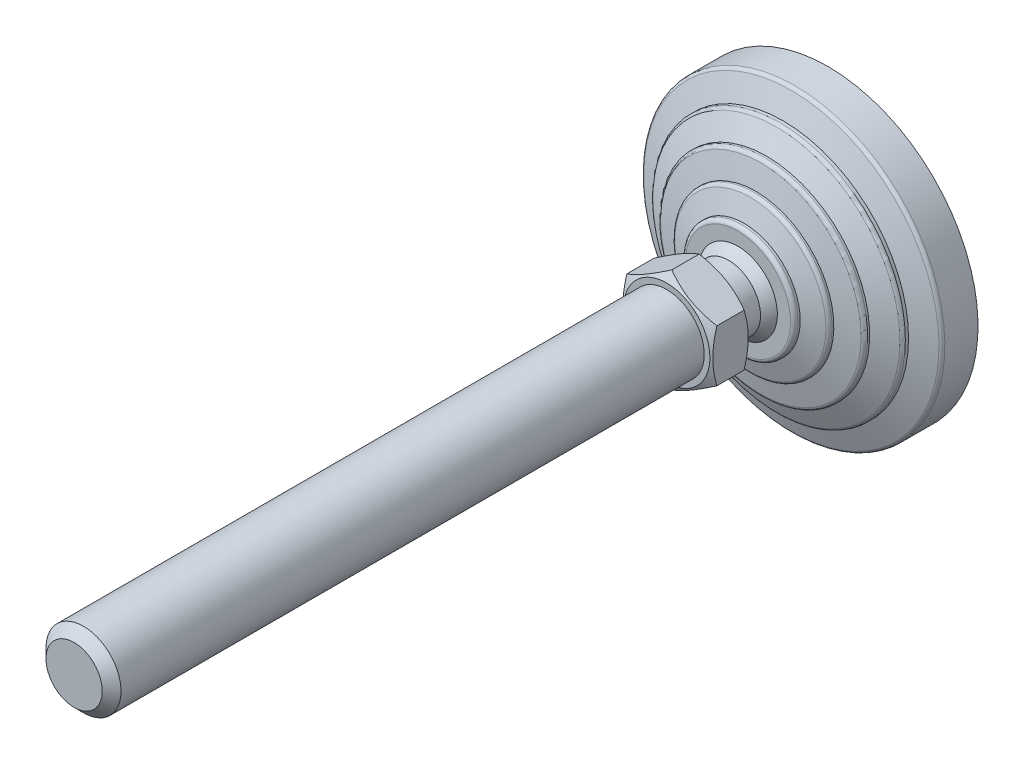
ISO-10303-21;
HEADER;
FILE_DESCRIPTION(('STEP AP214'),'2;1');
FILE_NAME('part.step','',(''),(''),'','','');
FILE_SCHEMA(('AUTOMOTIVE_DESIGN { 1 0 10303 214 1 1 1 1 }'));
ENDSEC;
DATA;
#1=APPLICATION_CONTEXT('core data for automotive mechanical design processes');
#2=APPLICATION_PROTOCOL_DEFINITION('international standard','automotive_design',2000,#1);
#3=PRODUCT_CONTEXT('',#1,'mechanical');
#4=PRODUCT('Part','Part','',(#3));
#5=PRODUCT_RELATED_PRODUCT_CATEGORY('part','',(#4));
#6=PRODUCT_DEFINITION_FORMATION('','',#4);
#7=PRODUCT_DEFINITION_CONTEXT('part definition',#1,'design');
#8=PRODUCT_DEFINITION('design','',#6,#7);
#9=PRODUCT_DEFINITION_SHAPE('','',#8);
#10=(LENGTH_UNIT() NAMED_UNIT(*) SI_UNIT(.MILLI.,.METRE.));
#11=(NAMED_UNIT(*) PLANE_ANGLE_UNIT() SI_UNIT($,.RADIAN.));
#12=(NAMED_UNIT(*) SI_UNIT($,.STERADIAN.) SOLID_ANGLE_UNIT());
#13=UNCERTAINTY_MEASURE_WITH_UNIT(LENGTH_MEASURE(1.E-05),#10,'distance_accuracy_value','');
#14=(GEOMETRIC_REPRESENTATION_CONTEXT(3) GLOBAL_UNCERTAINTY_ASSIGNED_CONTEXT((#13)) GLOBAL_UNIT_ASSIGNED_CONTEXT((#10,
#11,#12)) REPRESENTATION_CONTEXT('',''));
#15=CARTESIAN_POINT('',(0.,0.,0.));
#16=DIRECTION('',(0.,0.,1.));
#17=DIRECTION('',(1.,0.,0.));
#18=AXIS2_PLACEMENT_3D('',#15,#16,#17);
#19=CARTESIAN_POINT('',(-8.49999999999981,0.,32.9999999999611));
#20=DIRECTION('',(0.,0.,1.));
#21=DIRECTION('',(0.,-1.,0.));
#22=AXIS2_PLACEMENT_3D('',#19,#20,#21);
#23=PLANE('',#22);
#24=CARTESIAN_POINT('',(0.,0.,33.000000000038));
#25=DIRECTION('',(0.,0.,-1.));
#26=DIRECTION('',(-1.,0.,0.));
#27=AXIS2_PLACEMENT_3D('',#24,#25,#26);
#28=CIRCLE('',#27,11.5);
#29=CARTESIAN_POINT('',(-11.5,0.,33.000000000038));
#30=VERTEX_POINT('',#29);
#31=EDGE_CURVE('E570',#30,#30,#28,.T.);
#32=ORIENTED_EDGE('',*,*,#31,.T.);
#33=EDGE_LOOP('',(#32));
#34=FACE_BOUND('',#33,.T.);
#35=CARTESIAN_POINT('',(0.,0.,32.9999999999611));
#36=DIRECTION('',(0.,0.,-1.));
#37=DIRECTION('',(0.,1.,0.));
#38=AXIS2_PLACEMENT_3D('',#35,#36,#37);
#39=CIRCLE('',#38,8.49999999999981);
#40=CARTESIAN_POINT('',(0.,8.49999999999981,32.9999999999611));
#41=VERTEX_POINT('',#40);
#42=EDGE_CURVE('E150',#41,#41,#39,.T.);
#43=ORIENTED_EDGE('',*,*,#42,.F.);
#44=EDGE_LOOP('',(#43));
#45=FACE_BOUND('',#44,.T.);
#46=ADVANCED_FACE('F14',(#34,#45),#23,.F.);
#47=CARTESIAN_POINT('',(0.,0.,0.));
#48=DIRECTION('',(0.,0.,-1.));
#49=DIRECTION('',(0.,1.,0.));
#50=AXIS2_PLACEMENT_3D('',#47,#48,#49);
#51=CYLINDRICAL_SURFACE('',#50,8.49999999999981);
#52=CARTESIAN_POINT('',(0.,0.,26.4999999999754));
#53=DIRECTION('',(0.,0.,-1.));
#54=DIRECTION('',(0.,1.,0.));
#55=AXIS2_PLACEMENT_3D('',#52,#53,#54);
#56=CIRCLE('',#55,8.49999999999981);
#57=CARTESIAN_POINT('',(0.,8.49999999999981,26.4999999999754));
#58=VERTEX_POINT('',#57);
#59=EDGE_CURVE('E147',#58,#58,#56,.T.);
#60=ORIENTED_EDGE('',*,*,#59,.F.);
#61=EDGE_LOOP('',(#60));
#62=FACE_BOUND('',#61,.T.);
#63=ORIENTED_EDGE('',*,*,#42,.T.);
#64=EDGE_LOOP('',(#63));
#65=FACE_BOUND('',#64,.T.);
#66=ADVANCED_FACE('F174',(#62,#65),#51,.T.);
#67=CARTESIAN_POINT('',(-8.49107182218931,0.,26.4999999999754));
#68=DIRECTION('',(0.,0.,1.));
#69=DIRECTION('',(0.,-1.,0.));
#70=AXIS2_PLACEMENT_3D('',#67,#68,#69);
#71=PLANE('',#70);
#72=CARTESIAN_POINT('',(0.,0.,26.4999999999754));
#73=DIRECTION('',(0.,0.,-1.));
#74=DIRECTION('',(0.,1.,0.));
#75=AXIS2_PLACEMENT_3D('',#72,#73,#74);
#76=CIRCLE('',#75,8.49107182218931);
#77=CARTESIAN_POINT('',(-8.49107182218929,0.,26.4999999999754));
#78=VERTEX_POINT('',#77);
#79=EDGE_CURVE('E144',#78,#78,#76,.T.);
#80=ORIENTED_EDGE('',*,*,#79,.F.);
#81=EDGE_LOOP('',(#80));
#82=FACE_BOUND('',#81,.T.);
#83=ORIENTED_EDGE('',*,*,#59,.T.);
#84=EDGE_LOOP('',(#83));
#85=FACE_BOUND('',#84,.T.);
#86=ADVANCED_FACE('F181',(#82,#85),#71,.F.);
#87=CARTESIAN_POINT('',(-2.77555756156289E-12,0.,17.6702661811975));
#88=DIRECTION('',(0.,0.,-1.));
#89=DIRECTION('',(-1.,0.,0.));
#90=AXIS2_PLACEMENT_3D('',#87,#88,#89);
#91=SPHERICAL_SURFACE('',#90,12.25);
#92=CARTESIAN_POINT('',(0.,0.,24.));
#93=DIRECTION('',(0.,0.,-1.));
#94=DIRECTION('',(0.,1.,0.));
#95=AXIS2_PLACEMENT_3D('',#92,#93,#94);
#96=CIRCLE('',#95,10.4879440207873);
#97=CARTESIAN_POINT('',(-10.4879440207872,0.,24.));
#98=VERTEX_POINT('',#97);
#99=EDGE_CURVE('E141',#98,#98,#96,.T.);
#100=CARTESIAN_POINT('',(-10.4879440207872,0.,24.));
#101=CARTESIAN_POINT('',(-10.4706730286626,0.,24.0286168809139));
#102=CARTESIAN_POINT('',(-10.4532849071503,0.,24.0571630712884));
#103=CARTESIAN_POINT('',(-10.4182755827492,0.,24.1141121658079));
#104=CARTESIAN_POINT('',(-10.4006543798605,0.,24.1425150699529));
#105=CARTESIAN_POINT('',(-10.3651800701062,0.,24.1991756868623));
#106=CARTESIAN_POINT('',(-10.3473269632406,0.,24.2274333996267));
#107=CARTESIAN_POINT('',(-10.3113900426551,0.,24.283801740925));
#108=CARTESIAN_POINT('',(-10.2933062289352,0.,24.3119123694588));
#109=CARTESIAN_POINT('',(-10.2569091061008,0.,24.367984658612));
#110=CARTESIAN_POINT('',(-10.2385957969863,0.,24.3959463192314));
#111=CARTESIAN_POINT('',(-10.2017409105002,0.,24.4517187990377));
#112=CARTESIAN_POINT('',(-10.1831993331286,0.,24.4795296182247));
#113=CARTESIAN_POINT('',(-10.1458891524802,0.,24.5349985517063));
#114=CARTESIAN_POINT('',(-10.1271205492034,0.,24.5626566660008));
#115=CARTESIAN_POINT('',(-10.0893575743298,0.,24.6178183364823));
#116=CARTESIAN_POINT('',(-10.070363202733,0.,24.6453218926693));
#117=CARTESIAN_POINT('',(-10.0321499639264,0.,24.7001726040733));
#118=CARTESIAN_POINT('',(-10.0129310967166,0.,24.7275197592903));
#119=CARTESIAN_POINT('',(-9.97427015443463,0.,24.7820558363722));
#120=CARTESIAN_POINT('',(-9.95482807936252,0.,24.8092447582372));
#121=CARTESIAN_POINT('',(-9.91572202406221,0.,24.8634625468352));
#122=CARTESIAN_POINT('',(-9.89605804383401,0.,24.8904914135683));
#123=CARTESIAN_POINT('',(-9.85650949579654,0.,24.9443872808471));
#124=CARTESIAN_POINT('',(-9.83662492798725,0.,24.9712542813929));
#125=CARTESIAN_POINT('',(-9.79663653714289,0.,25.0248246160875));
#126=CARTESIAN_POINT('',(-9.77653271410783,0.,25.0515279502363));
#127=CARTESIAN_POINT('',(-9.73610715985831,0.,25.1047691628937));
#128=CARTESIAN_POINT('',(-9.71578542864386,0.,25.1313070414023));
#129=CARTESIAN_POINT('',(-9.67492541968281,0.,25.1842155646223));
#130=CARTESIAN_POINT('',(-9.65438714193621,0.,25.2105862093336));
#131=CARTESIAN_POINT('',(-9.61309541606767,0.,25.2631584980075));
#132=CARTESIAN_POINT('',(-9.59234196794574,0.,25.28936014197));
#133=CARTESIAN_POINT('',(-9.55062129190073,0.,25.3415926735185));
#134=CARTESIAN_POINT('',(-9.52965406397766,0.,25.3676235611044));
#135=CARTESIAN_POINT('',(-9.48750723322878,0.,25.4195128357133));
#136=CARTESIAN_POINT('',(-9.46632763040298,0.,25.4453712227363));
#137=CARTESIAN_POINT('',(-9.42375746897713,0.,25.4969137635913));
#138=CARTESIAN_POINT('',(-9.40236691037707,0.,25.5225979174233));
#139=CARTESIAN_POINT('',(-9.35937627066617,0.,25.5737902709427));
#140=CARTESIAN_POINT('',(-9.33777618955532,0.,25.5992984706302));
#141=CARTESIAN_POINT('',(-9.29436795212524,0.,25.6501372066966));
#142=CARTESIAN_POINT('',(-9.27255979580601,0.,25.6754677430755));
#143=CARTESIAN_POINT('',(-9.22873686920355,0.,25.7259494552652));
#144=CARTESIAN_POINT('',(-9.20672209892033,0.,25.751100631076));
#145=CARTESIAN_POINT('',(-9.16248741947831,0.,25.8012219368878));
#146=CARTESIAN_POINT('',(-9.14026751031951,0.,25.8261920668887));
#147=CARTESIAN_POINT('',(-9.0956240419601,0.,25.87594960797));
#148=CARTESIAN_POINT('',(-9.07320048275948,0.,25.9007370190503));
#149=CARTESIAN_POINT('',(-9.0281512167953,0.,25.9501274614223));
#150=CARTESIAN_POINT('',(-9.00552551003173,0.,25.9747304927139));
#151=CARTESIAN_POINT('',(-8.96007346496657,0.,26.023750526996));
#152=CARTESIAN_POINT('',(-8.93724712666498,0.,26.0481675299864));
#153=CARTESIAN_POINT('',(-8.8913953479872,0.,26.0968138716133));
#154=CARTESIAN_POINT('',(-8.868369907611,0.,26.1210432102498));
#155=CARTESIAN_POINT('',(-8.82212146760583,0.,26.1693125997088));
#156=CARTESIAN_POINT('',(-8.79889846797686,0.,26.1933526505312));
#157=CARTESIAN_POINT('',(-8.75225646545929,0.,26.2412418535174));
#158=CARTESIAN_POINT('',(-8.72883746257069,0.,26.2650910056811));
#159=CARTESIAN_POINT('',(-8.68180502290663,0.,26.3125968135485));
#160=CARTESIAN_POINT('',(-8.65819158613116,0.,26.3362534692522));
#161=CARTESIAN_POINT('',(-8.61077186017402,0.,26.383372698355));
#162=CARTESIAN_POINT('',(-8.58696557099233,0.,26.4068352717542));
#163=CARTESIAN_POINT('',(-8.53916173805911,0.,26.4535647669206));
#164=CARTESIAN_POINT('',(-8.51516419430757,0.,26.4768316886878));
#165=CARTESIAN_POINT('',(-8.49107182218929,0.,26.4999999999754));
#166=B_SPLINE_CURVE_WITH_KNOTS('',3,(#100,#101,#102,#103,#104,#105,#106,#107,#108,#109,#110,
#111,#112,#113,#114,#115,#116,#117,#118,#119,#120,#121,#122,#123,#124,#125,#126,#127,#128,#129,
#130,#131,#132,#133,#134,#135,#136,#137,#138,#139,#140,#141,#142,#143,#144,#145,#146,#147,#148,
#149,#150,#151,#152,#153,#154,#155,#156,#157,#158,#159,#160,#161,#162,#163,#164,#165),
.UNSPECIFIED.,.F.,.F.,(4,2,2,2,2,2,2,2,2,2,2,2,2,2,2,2,2,2,2,2,2,2,2,2,2,2,2,2,2,2,2,2,4),(0.,
0.100273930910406,0.20054786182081,0.30082179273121,0.401095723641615,0.501369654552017,
0.601643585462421,0.701917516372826,0.802191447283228,0.90246537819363,1.00273930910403,
1.10301324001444,1.20328717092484,1.30356110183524,1.40383503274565,1.50410896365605,
1.60438289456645,1.70465682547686,1.80493075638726,1.90520468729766,2.00547861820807,
2.10575254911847,2.20602648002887,2.30630041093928,2.40657434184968,2.50684827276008,
2.60712220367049,2.70739613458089,2.80767006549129,2.90794399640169,3.0082179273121,
3.1084918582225,3.2087657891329),.UNSPECIFIED.);
#167=EDGE_CURVE('BSEAM433',#98,#78,#166,.T.);
#168=ORIENTED_EDGE('',*,*,#99,.F.);
#169=ORIENTED_EDGE('',*,*,#79,.T.);
#170=ORIENTED_EDGE('',*,*,#167,.T.);
#171=ORIENTED_EDGE('',*,*,#167,.F.);
#172=EDGE_LOOP('',(#168,#170,#169,#171));
#173=FACE_BOUND('',#172,.T.);
#174=ADVANCED_FACE('F433',(#173),#91,.T.);
#175=CARTESIAN_POINT('',(-10.4879440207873,0.,24.));
#176=DIRECTION('',(0.,0.,-1.));
#177=DIRECTION('',(0.,1.,0.));
#178=AXIS2_PLACEMENT_3D('',#175,#176,#177);
#179=PLANE('',#178);
#180=CARTESIAN_POINT('',(0.,0.,24.));
#181=DIRECTION('',(0.,0.,-1.));
#182=DIRECTION('',(0.,1.,0.));
#183=AXIS2_PLACEMENT_3D('',#180,#181,#182);
#184=CIRCLE('',#183,13.9999999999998);
#185=CARTESIAN_POINT('',(0.,13.9999999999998,24.));
#186=VERTEX_POINT('',#185);
#187=EDGE_CURVE('E138',#186,#186,#184,.T.);
#188=ORIENTED_EDGE('',*,*,#187,.F.);
#189=EDGE_LOOP('',(#188));
#190=FACE_BOUND('',#189,.T.);
#191=ORIENTED_EDGE('',*,*,#99,.T.);
#192=EDGE_LOOP('',(#191));
#193=FACE_BOUND('',#192,.T.);
#194=ADVANCED_FACE('F423',(#190,#193),#179,.F.);
#195=CARTESIAN_POINT('',(0.,0.,23.));
#196=DIRECTION('',(0.,0.,-1.));
#197=DIRECTION('',(0.,1.,0.));
#198=AXIS2_PLACEMENT_3D('',#195,#196,#197);
#199=TOROIDAL_SURFACE('',#198,13.9999999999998,1.);
#200=CARTESIAN_POINT('',(0.,0.,23.));
#201=DIRECTION('',(0.,0.,-1.));
#202=DIRECTION('',(0.,1.,0.));
#203=AXIS2_PLACEMENT_3D('',#200,#201,#202);
#204=CIRCLE('',#203,14.9999999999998);
#205=CARTESIAN_POINT('',(0.,14.9999999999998,23.));
#206=VERTEX_POINT('',#205);
#207=EDGE_CURVE('E135',#206,#206,#204,.T.);
#208=ORIENTED_EDGE('',*,*,#207,.F.);
#209=EDGE_LOOP('',(#208));
#210=FACE_BOUND('',#209,.T.);
#211=ORIENTED_EDGE('',*,*,#187,.T.);
#212=EDGE_LOOP('',(#211));
#213=FACE_BOUND('',#212,.T.);
#214=ADVANCED_FACE('F413',(#210,#213),#199,.T.);
#215=CARTESIAN_POINT('',(0.,0.,0.));
#216=DIRECTION('',(0.,0.,-1.));
#217=DIRECTION('',(0.,1.,0.));
#218=AXIS2_PLACEMENT_3D('',#215,#216,#217);
#219=CYLINDRICAL_SURFACE('',#218,14.9999999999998);
#220=CARTESIAN_POINT('',(0.,0.,22.4025287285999));
#221=DIRECTION('',(0.,0.,-1.));
#222=DIRECTION('',(0.,1.,0.));
#223=AXIS2_PLACEMENT_3D('',#220,#221,#222);
#224=CIRCLE('',#223,14.9999999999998);
#225=CARTESIAN_POINT('',(0.,14.9999999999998,22.4025287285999));
#226=VERTEX_POINT('',#225);
#227=EDGE_CURVE('E132',#226,#226,#224,.T.);
#228=ORIENTED_EDGE('',*,*,#227,.F.);
#229=EDGE_LOOP('',(#228));
#230=FACE_BOUND('',#229,.T.);
#231=ORIENTED_EDGE('',*,*,#207,.T.);
#232=EDGE_LOOP('',(#231));
#233=FACE_BOUND('',#232,.T.);
#234=ADVANCED_FACE('F403',(#230,#233),#219,.T.);
#235=CARTESIAN_POINT('',(0.,0.,22.4025287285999));
#236=DIRECTION('',(0.,0.,-1.));
#237=DIRECTION('',(0.,1.,0.));
#238=AXIS2_PLACEMENT_3D('',#235,#236,#237);
#239=CONICAL_SURFACE('',#238,14.9999999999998,1.25589726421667);
#240=CARTESIAN_POINT('',(0.,0.,20.7216684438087));
#241=DIRECTION('',(0.,0.,-1.));
#242=DIRECTION('',(0.,1.,0.));
#243=AXIS2_PLACEMENT_3D('',#240,#241,#242);
#244=CIRCLE('',#243,20.1601635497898);
#245=CARTESIAN_POINT('',(0.,20.1601635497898,20.7216684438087));
#246=VERTEX_POINT('',#245);
#247=EDGE_CURVE('E129',#246,#246,#244,.T.);
#248=ORIENTED_EDGE('',*,*,#247,.F.);
#249=EDGE_LOOP('',(#248));
#250=FACE_BOUND('',#249,.T.);
#251=ORIENTED_EDGE('',*,*,#227,.T.);
#252=EDGE_LOOP('',(#251));
#253=FACE_BOUND('',#252,.T.);
#254=ADVANCED_FACE('F393',(#250,#253),#239,.T.);
#255=CARTESIAN_POINT('',(0.,0.,19.7708407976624));
#256=DIRECTION('',(0.,0.,-1.));
#257=DIRECTION('',(0.,1.,0.));
#258=AXIS2_PLACEMENT_3D('',#255,#256,#257);
#259=TOROIDAL_SURFACE('',#258,19.8504430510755,1.);
#260=CARTESIAN_POINT('',(0.,0.,19.7708407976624));
#261=DIRECTION('',(0.,0.,-1.));
#262=DIRECTION('',(0.,1.,0.));
#263=AXIS2_PLACEMENT_3D('',#260,#261,#262);
#264=CIRCLE('',#263,20.8504430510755);
#265=CARTESIAN_POINT('',(0.,20.8504430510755,19.7708407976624));
#266=VERTEX_POINT('',#265);
#267=EDGE_CURVE('E126',#266,#266,#264,.T.);
#268=ORIENTED_EDGE('',*,*,#267,.F.);
#269=EDGE_LOOP('',(#268));
#270=FACE_BOUND('',#269,.T.);
#271=ORIENTED_EDGE('',*,*,#247,.T.);
#272=EDGE_LOOP('',(#271));
#273=FACE_BOUND('',#272,.T.);
#274=ADVANCED_FACE('F383',(#270,#273),#259,.T.);
#275=CARTESIAN_POINT('',(0.,0.,0.));
#276=DIRECTION('',(0.,0.,-1.));
#277=DIRECTION('',(0.,1.,0.));
#278=AXIS2_PLACEMENT_3D('',#275,#276,#277);
#279=CYLINDRICAL_SURFACE('',#278,20.8504430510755);
#280=CARTESIAN_POINT('',(0.,0.,19.2987385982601));
#281=DIRECTION('',(0.,0.,-1.));
#282=DIRECTION('',(0.,1.,0.));
#283=AXIS2_PLACEMENT_3D('',#280,#281,#282);
#284=CIRCLE('',#283,20.8504430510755);
#285=CARTESIAN_POINT('',(0.,20.8504430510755,19.2987385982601));
#286=VERTEX_POINT('',#285);
#287=EDGE_CURVE('E123',#286,#286,#284,.T.);
#288=ORIENTED_EDGE('',*,*,#287,.F.);
#289=EDGE_LOOP('',(#288));
#290=FACE_BOUND('',#289,.T.);
#291=ORIENTED_EDGE('',*,*,#267,.T.);
#292=EDGE_LOOP('',(#291));
#293=FACE_BOUND('',#292,.T.);
#294=ADVANCED_FACE('F373',(#290,#293),#279,.T.);
#295=CARTESIAN_POINT('',(0.,0.,19.2987385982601));
#296=DIRECTION('',(0.,0.,-1.));
#297=DIRECTION('',(0.,1.,0.));
#298=AXIS2_PLACEMENT_3D('',#295,#296,#297);
#299=CONICAL_SURFACE('',#298,20.8504430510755,1.34067144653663);
#300=CARTESIAN_POINT('',(0.,0.,17.9217501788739));
#301=DIRECTION('',(0.,0.,-1.));
#302=DIRECTION('',(0.,1.,0.));
#303=AXIS2_PLACEMENT_3D('',#300,#301,#302);
#304=CIRCLE('',#303,26.7280991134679);
#305=CARTESIAN_POINT('',(0.,26.7280991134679,17.9217501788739));
#306=VERTEX_POINT('',#305);
#307=EDGE_CURVE('E120',#306,#306,#304,.T.);
#308=ORIENTED_EDGE('',*,*,#307,.F.);
#309=EDGE_LOOP('',(#308));
#310=FACE_BOUND('',#309,.T.);
#311=ORIENTED_EDGE('',*,*,#287,.T.);
#312=EDGE_LOOP('',(#311));
#313=FACE_BOUND('',#312,.T.);
#314=ADVANCED_FACE('F363',(#310,#313),#299,.T.);
#315=CARTESIAN_POINT('',(0.,0.,16.9481122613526));
#316=DIRECTION('',(0.,0.,-1.));
#317=DIRECTION('',(0.,1.,0.));
#318=AXIS2_PLACEMENT_3D('',#315,#316,#317);
#319=TOROIDAL_SURFACE('',#318,26.5,1.00000000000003);
#320=CARTESIAN_POINT('',(0.,0.,16.9481122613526));
#321=DIRECTION('',(0.,0.,-1.));
#322=DIRECTION('',(0.,1.,0.));
#323=AXIS2_PLACEMENT_3D('',#320,#321,#322);
#324=CIRCLE('',#323,27.5);
#325=CARTESIAN_POINT('',(0.,27.5,16.9481122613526));
#326=VERTEX_POINT('',#325);
#327=EDGE_CURVE('E117',#326,#326,#324,.T.);
#328=ORIENTED_EDGE('',*,*,#327,.F.);
#329=EDGE_LOOP('',(#328));
#330=FACE_BOUND('',#329,.T.);
#331=ORIENTED_EDGE('',*,*,#307,.T.);
#332=EDGE_LOOP('',(#331));
#333=FACE_BOUND('',#332,.T.);
#334=ADVANCED_FACE('F353',(#330,#333),#319,.T.);
#335=CARTESIAN_POINT('',(0.,0.,0.));
#336=DIRECTION('',(0.,0.,-1.));
#337=DIRECTION('',(0.,1.,0.));
#338=AXIS2_PLACEMENT_3D('',#335,#336,#337);
#339=CYLINDRICAL_SURFACE('',#338,27.5);
#340=CARTESIAN_POINT('',(0.,0.,16.4025287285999));
#341=DIRECTION('',(0.,0.,-1.));
#342=DIRECTION('',(0.,1.,0.));
#343=AXIS2_PLACEMENT_3D('',#340,#341,#342);
#344=CIRCLE('',#343,27.5);
#345=CARTESIAN_POINT('',(0.,27.5,16.4025287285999));
#346=VERTEX_POINT('',#345);
#347=EDGE_CURVE('E114',#346,#346,#344,.T.);
#348=ORIENTED_EDGE('',*,*,#347,.F.);
#349=EDGE_LOOP('',(#348));
#350=FACE_BOUND('',#349,.T.);
#351=ORIENTED_EDGE('',*,*,#327,.T.);
#352=EDGE_LOOP('',(#351));
#353=FACE_BOUND('',#352,.T.);
#354=ADVANCED_FACE('F343',(#350,#353),#339,.T.);
#355=CARTESIAN_POINT('',(0.,0.,16.4025287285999));
#356=DIRECTION('',(0.,0.,-1.));
#357=DIRECTION('',(0.,1.,0.));
#358=AXIS2_PLACEMENT_3D('',#355,#356,#357);
#359=CONICAL_SURFACE('',#358,27.5,1.1202291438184);
#360=CARTESIAN_POINT('',(0.,0.,13.7730910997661));
#361=DIRECTION('',(0.,0.,-1.));
#362=DIRECTION('',(0.,1.,0.));
#363=AXIS2_PLACEMENT_3D('',#360,#361,#362);
#364=CIRCLE('',#363,32.935476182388);
#365=CARTESIAN_POINT('',(0.,32.935476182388,13.7730910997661));
#366=VERTEX_POINT('',#365);
#367=EDGE_CURVE('E111',#366,#366,#364,.T.);
#368=ORIENTED_EDGE('',*,*,#367,.F.);
#369=EDGE_LOOP('',(#368));
#370=FACE_BOUND('',#369,.T.);
#371=ORIENTED_EDGE('',*,*,#347,.T.);
#372=EDGE_LOOP('',(#371));
#373=FACE_BOUND('',#372,.T.);
#374=ADVANCED_FACE('F333',(#370,#373),#359,.T.);
#375=CARTESIAN_POINT('',(0.,0.,12.8728908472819));
#376=DIRECTION('',(0.,0.,-1.));
#377=DIRECTION('',(0.,1.,0.));
#378=AXIS2_PLACEMENT_3D('',#375,#376,#377);
#379=TOROIDAL_SURFACE('',#378,32.5,0.999999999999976);
#380=CARTESIAN_POINT('',(0.,0.,12.8728908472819));
#381=DIRECTION('',(0.,0.,-1.));
#382=DIRECTION('',(0.,1.,0.));
#383=AXIS2_PLACEMENT_3D('',#380,#381,#382);
#384=CIRCLE('',#383,33.5);
#385=CARTESIAN_POINT('',(0.,33.5,12.8728908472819));
#386=VERTEX_POINT('',#385);
#387=EDGE_CURVE('E108',#386,#386,#384,.T.);
#388=ORIENTED_EDGE('',*,*,#387,.F.);
#389=EDGE_LOOP('',(#388));
#390=FACE_BOUND('',#389,.T.);
#391=ORIENTED_EDGE('',*,*,#367,.T.);
#392=EDGE_LOOP('',(#391));
#393=FACE_BOUND('',#392,.T.);
#394=ADVANCED_FACE('F323',(#390,#393),#379,.T.);
#395=CARTESIAN_POINT('',(0.,0.,0.));
#396=DIRECTION('',(0.,0.,-1.));
#397=DIRECTION('',(0.,1.,0.));
#398=AXIS2_PLACEMENT_3D('',#395,#396,#397);
#399=CYLINDRICAL_SURFACE('',#398,33.5);
#400=CARTESIAN_POINT('',(0.,0.,12.0315037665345));
#401=DIRECTION('',(0.,0.,-1.));
#402=DIRECTION('',(0.,1.,0.));
#403=AXIS2_PLACEMENT_3D('',#400,#401,#402);
#404=CIRCLE('',#403,33.5);
#405=CARTESIAN_POINT('',(0.,33.5,12.0315037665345));
#406=VERTEX_POINT('',#405);
#407=EDGE_CURVE('E105',#406,#406,#404,.T.);
#408=ORIENTED_EDGE('',*,*,#407,.F.);
#409=EDGE_LOOP('',(#408));
#410=FACE_BOUND('',#409,.T.);
#411=ORIENTED_EDGE('',*,*,#387,.T.);
#412=EDGE_LOOP('',(#411));
#413=FACE_BOUND('',#412,.T.);
#414=ADVANCED_FACE('F313',(#410,#413),#399,.T.);
#415=CARTESIAN_POINT('',(0.,0.,12.0315037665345));
#416=DIRECTION('',(0.,0.,-1.));
#417=DIRECTION('',(0.,1.,0.));
#418=AXIS2_PLACEMENT_3D('',#415,#416,#417);
#419=CONICAL_SURFACE('',#418,33.5,1.20362249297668);
#420=CARTESIAN_POINT('',(0.,0.,9.77805027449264));
#421=DIRECTION('',(0.,0.,-1.));
#422=DIRECTION('',(0.,1.,0.));
#423=AXIS2_PLACEMENT_3D('',#420,#421,#422);
#424=CIRCLE('',#423,39.3589790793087);
#425=CARTESIAN_POINT('',(0.,39.3589790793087,9.77805027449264));
#426=VERTEX_POINT('',#425);
#427=EDGE_CURVE('E102',#426,#426,#424,.T.);
#428=ORIENTED_EDGE('',*,*,#427,.F.);
#429=EDGE_LOOP('',(#428));
#430=FACE_BOUND('',#429,.T.);
#431=ORIENTED_EDGE('',*,*,#407,.T.);
#432=EDGE_LOOP('',(#431));
#433=FACE_BOUND('',#432,.T.);
#434=ADVANCED_FACE('F303',(#430,#433),#419,.T.);
#435=CARTESIAN_POINT('',(0.,0.,8.84470466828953));
#436=DIRECTION('',(0.,0.,-1.));
#437=DIRECTION('',(0.,1.,0.));
#438=AXIS2_PLACEMENT_3D('',#435,#436,#437);
#439=TOROIDAL_SURFACE('',#438,39.,1.00000000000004);
#440=CARTESIAN_POINT('',(0.,0.,8.84470466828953));
#441=DIRECTION('',(0.,0.,-1.));
#442=DIRECTION('',(0.,1.,0.));
#443=AXIS2_PLACEMENT_3D('',#440,#441,#442);
#444=CIRCLE('',#443,40.);
#445=CARTESIAN_POINT('',(0.,40.,8.84470466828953));
#446=VERTEX_POINT('',#445);
#447=EDGE_CURVE('E99',#446,#446,#444,.T.);
#448=ORIENTED_EDGE('',*,*,#447,.F.);
#449=EDGE_LOOP('',(#448));
#450=FACE_BOUND('',#449,.T.);
#451=ORIENTED_EDGE('',*,*,#427,.T.);
#452=EDGE_LOOP('',(#451));
#453=FACE_BOUND('',#452,.T.);
#454=ADVANCED_FACE('F293',(#450,#453),#439,.T.);
#455=CARTESIAN_POINT('',(0.,0.,0.));
#456=DIRECTION('',(0.,0.,-1.));
#457=DIRECTION('',(0.,1.,0.));
#458=AXIS2_PLACEMENT_3D('',#455,#456,#457);
#459=CYLINDRICAL_SURFACE('',#458,40.);
#460=CARTESIAN_POINT('',(0.,0.,0.));
#461=DIRECTION('',(0.,0.,-1.));
#462=DIRECTION('',(0.,1.,0.));
#463=AXIS2_PLACEMENT_3D('',#460,#461,#462);
#464=CIRCLE('',#463,40.);
#465=CARTESIAN_POINT('',(0.,40.,0.));
#466=VERTEX_POINT('',#465);
#467=EDGE_CURVE('E96',#466,#466,#464,.T.);
#468=ORIENTED_EDGE('',*,*,#467,.F.);
#469=EDGE_LOOP('',(#468));
#470=FACE_BOUND('',#469,.T.);
#471=ORIENTED_EDGE('',*,*,#447,.T.);
#472=EDGE_LOOP('',(#471));
#473=FACE_BOUND('',#472,.T.);
#474=ADVANCED_FACE('F282',(#470,#473),#459,.T.);
#475=CARTESIAN_POINT('',(0.,0.,0.));
#476=DIRECTION('',(0.,0.,1.));
#477=DIRECTION('',(0.,-1.,0.));
#478=AXIS2_PLACEMENT_3D('',#475,#476,#477);
#479=PLANE('',#478);
#480=ORIENTED_EDGE('',*,*,#467,.T.);
#481=EDGE_LOOP('',(#480));
#482=FACE_BOUND('',#481,.T.);
#483=ADVANCED_FACE('F172',(#482),#479,.F.);
#484=CARTESIAN_POINT('',(0.,0.,35.8332546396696));
#485=DIRECTION('',(0.,0.,1.));
#486=DIRECTION('',(1.,0.,0.));
#487=AXIS2_PLACEMENT_3D('',#484,#485,#486);
#488=CONICAL_SURFACE('',#487,16.4073409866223,1.04719755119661);
#489=CARTESIAN_POINT('',(0.000200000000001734,-13.8565219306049,34.3605385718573));
#490=CARTESIAN_POINT('',(-0.263585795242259,-13.7042251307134,34.2726247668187));
#491=CARTESIAN_POINT('',(-0.528355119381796,-13.5513604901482,34.1887011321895));
#492=CARTESIAN_POINT('',(-1.06001701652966,-13.2444053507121,34.0299413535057));
#493=CARTESIAN_POINT('',(-1.32691025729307,-13.0903144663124,33.9551081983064));
#494=CARTESIAN_POINT('',(-2.13189040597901,-12.6255589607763,33.745692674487));
#495=CARTESIAN_POINT('',(-2.6731550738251,-12.3130596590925,33.6265783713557));
#496=CARTESIAN_POINT('',(-3.483132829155,-11.8454187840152,33.486906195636));
#497=CARTESIAN_POINT('',(-3.74942610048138,-11.6916742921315,33.4471189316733));
#498=CARTESIAN_POINT('',(-4.28324559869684,-11.3834734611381,33.3803985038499));
#499=CARTESIAN_POINT('',(-4.55077184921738,-11.2290171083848,33.3534655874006));
#500=CARTESIAN_POINT('',(-5.08627036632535,-10.9198468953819,33.3131437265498));
#501=CARTESIAN_POINT('',(-5.35424172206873,-10.7651335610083,33.2997386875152));
#502=CARTESIAN_POINT('',(-5.89043273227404,-10.4555635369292,33.28675822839));
#503=CARTESIAN_POINT('',(-6.15865237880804,-10.3007068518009,33.2871823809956));
#504=CARTESIAN_POINT('',(-6.66008937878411,-10.0112020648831,33.3008951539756));
#505=CARTESIAN_POINT('',(-6.89334249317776,-9.87653331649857,33.3125111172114));
#506=CARTESIAN_POINT('',(-7.35931224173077,-9.60750555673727,33.3459831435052));
#507=CARTESIAN_POINT('',(-7.59202883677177,-9.47314656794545,33.3678399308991));
#508=CARTESIAN_POINT('',(-8.05679907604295,-9.20481134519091,33.4214125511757));
#509=CARTESIAN_POINT('',(-8.28885201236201,-9.07083551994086,33.4531365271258));
#510=CARTESIAN_POINT('',(-8.75186996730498,-8.80351197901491,33.5258869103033));
#511=CARTESIAN_POINT('',(-8.98283491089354,-8.67016430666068,33.566913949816));
#512=CARTESIAN_POINT('',(-9.68394195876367,-8.26537996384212,33.7049867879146));
#513=CARTESIAN_POINT('',(-10.1520537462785,-7.99511549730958,33.8158000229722));
#514=CARTESIAN_POINT('',(-11.0812971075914,-7.45861659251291,34.0673009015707));
#515=CARTESIAN_POINT('',(-11.5424405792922,-7.19237528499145,34.2079294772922));
#516=CARTESIAN_POINT('',(-12.0002,-6.92808776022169,34.3605385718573));
#517=B_SPLINE_CURVE_WITH_KNOTS('',3,(#489,#490,#491,#492,#493,#494,#495,#496,#497,#498,#499,
#500,#501,#502,#503,#504,#505,#506,#507,#508,#509,#510,#511,#512,#513,#514,#515,#516),
.UNSPECIFIED.,.F.,.F.,(4,2,2,2,2,2,2,2,2,2,2,2,2,4),(0.,0.951004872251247,1.90232158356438,
3.80900466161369,4.73894551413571,5.6689042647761,6.59775529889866,7.52657763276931,
8.33514643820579,9.1437724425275,9.95306755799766,10.7624176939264,12.4167102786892,
14.0677556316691),.UNSPECIFIED.);
#518=CARTESIAN_POINT('',(0.,-13.856406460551,34.3604719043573));
#519=VERTEX_POINT('',#518);
#520=CARTESIAN_POINT('',(-12.,-6.92820323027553,34.3604719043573));
#521=VERTEX_POINT('',#520);
#522=EDGE_CURVE('E73',#519,#521,#517,.T.);
#523=ORIENTED_EDGE('',*,*,#522,.T.);
#524=CARTESIAN_POINT('',(-12.,-18.5393631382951,39.1107396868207));
#525=CARTESIAN_POINT('',(-12.,-18.2776051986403,38.9838736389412));
#526=CARTESIAN_POINT('',(-12.,-18.0155381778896,38.8576456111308));
#527=CARTESIAN_POINT('',(-12.,-17.4907214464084,38.6066102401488));
#528=CARTESIAN_POINT('',(-12.,-17.2279717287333,38.481802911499));
#529=CARTESIAN_POINT('',(-12.,-16.4385307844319,38.1096955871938));
#530=CARTESIAN_POINT('',(-12.,-15.9107263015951,37.8647484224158));
#531=CARTESIAN_POINT('',(-12.,-14.8486551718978,37.3812891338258));
#532=CARTESIAN_POINT('',(-12.,-14.3143689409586,37.1428199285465));
#533=CARTESIAN_POINT('',(-12.,-13.2415226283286,36.675731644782));
#534=CARTESIAN_POINT('',(-12.,-12.7029627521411,36.4471120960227));
#535=CARTESIAN_POINT('',(-12.,-11.6036121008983,35.9953041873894));
#536=CARTESIAN_POINT('',(-12.,-11.0426563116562,35.7725152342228));
#537=CARTESIAN_POINT('',(-12.,-9.91415189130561,35.3439697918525));
#538=CARTESIAN_POINT('',(-12.,-9.34660252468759,35.1382152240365));
#539=CARTESIAN_POINT('',(-12.,-8.20511202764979,34.7491947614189));
#540=CARTESIAN_POINT('',(-12.,-7.63118675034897,34.5658827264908));
#541=CARTESIAN_POINT('',(-12.,-6.47504946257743,34.227666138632));
#542=CARTESIAN_POINT('',(-12.,-5.89284014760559,34.0727525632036));
#543=CARTESIAN_POINT('',(-12.,-5.0148210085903,33.8677429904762));
#544=CARTESIAN_POINT('',(-12.,-4.72215438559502,33.8041008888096));
#545=CARTESIAN_POINT('',(-12.,-4.13483474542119,33.6867025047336));
#546=CARTESIAN_POINT('',(-12.,-3.84018177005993,33.6329460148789));
#547=CARTESIAN_POINT('',(-12.,-3.24909739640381,33.5362719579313));
#548=CARTESIAN_POINT('',(-12.,-2.95266601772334,33.4933542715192));
#549=CARTESIAN_POINT('',(-12.,-2.3583451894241,33.4192166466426));
#550=CARTESIAN_POINT('',(-12.,-2.06045579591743,33.3879962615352));
#551=CARTESIAN_POINT('',(-12.,-1.46749368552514,33.3382609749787));
#552=CARTESIAN_POINT('',(-12.,-1.17243440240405,33.3195868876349));
#553=CARTESIAN_POINT('',(-12.,-0.581791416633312,33.2947283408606));
#554=CARTESIAN_POINT('',(-12.,-0.28620772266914,33.2885436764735));
#555=CARTESIAN_POINT('',(-12.,0.304957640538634,33.2888108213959));
#556=CARTESIAN_POINT('',(-12.,0.60053930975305,33.2952627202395));
#557=CARTESIAN_POINT('',(-12.,1.19116983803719,33.3206468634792));
#558=CARTESIAN_POINT('',(-12.,1.48621867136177,33.3395796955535));
#559=CARTESIAN_POINT('',(-12.,2.19745849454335,33.3998635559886));
#560=CARTESIAN_POINT('',(-12.,2.6131463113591,33.4472553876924));
#561=CARTESIAN_POINT('',(-12.,3.4413926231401,33.5642149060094));
#562=CARTESIAN_POINT('',(-12.,3.85395067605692,33.6337856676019));
#563=CARTESIAN_POINT('',(-12.,4.67555907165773,33.7926280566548));
#564=CARTESIAN_POINT('',(-12.,5.08460637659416,33.8819152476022));
#565=CARTESIAN_POINT('',(-12.,5.89857625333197,34.0774700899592));
#566=CARTESIAN_POINT('',(-12.,6.30349889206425,34.1837374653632));
#567=CARTESIAN_POINT('',(-12.,7.11809682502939,34.4131752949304));
#568=CARTESIAN_POINT('',(-12.,7.52768143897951,34.5366654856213));
#569=CARTESIAN_POINT('',(-12.,8.34281494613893,34.7962484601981));
#570=CARTESIAN_POINT('',(-12.,8.74836381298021,34.9323413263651));
#571=CARTESIAN_POINT('',(-12.,9.55562915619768,35.2149824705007));
#572=CARTESIAN_POINT('',(-12.,9.95734689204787,35.3615271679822));
#573=CARTESIAN_POINT('',(-12.,10.7574639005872,35.6633632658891));
#574=CARTESIAN_POINT('',(-12.,11.1558632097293,35.8186545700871));
#575=CARTESIAN_POINT('',(-12.,12.0862371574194,36.1911932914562));
#576=CARTESIAN_POINT('',(-12.,12.6170321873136,36.4113819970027));
#577=CARTESIAN_POINT('',(-12.,13.6741972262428,36.8621670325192));
#578=CARTESIAN_POINT('',(-12.,14.2005669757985,37.0927639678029));
#579=CARTESIAN_POINT('',(-12.,15.2496934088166,37.5623072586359));
#580=CARTESIAN_POINT('',(-12.,15.772449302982,37.801255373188));
#581=CARTESIAN_POINT('',(-12.,16.8148322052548,38.2858385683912));
#582=CARTESIAN_POINT('',(-12.,17.3344592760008,38.5314735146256));
#583=CARTESIAN_POINT('',(-12.,18.3716421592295,39.0284563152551));
#584=CARTESIAN_POINT('',(-12.,18.8891952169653,39.2798099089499));
#585=CARTESIAN_POINT('',(-12.,19.9220929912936,39.787013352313));
#586=CARTESIAN_POINT('',(-12.,20.4374376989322,40.04286322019));
#587=CARTESIAN_POINT('',(-12.,21.4661914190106,40.5582655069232));
#588=CARTESIAN_POINT('',(-12.,21.9796006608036,40.8178174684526));
#589=CARTESIAN_POINT('',(-12.,23.004823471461,41.3400556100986));
#590=CARTESIAN_POINT('',(-12.,23.5166370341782,41.602741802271));
#591=CARTESIAN_POINT('',(-12.,24.9659375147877,42.3513206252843));
#592=CARTESIAN_POINT('',(-12.,25.9018105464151,42.8403378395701));
#593=CARTESIAN_POINT('',(-12.,27.7700793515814,43.8250299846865));
#594=CARTESIAN_POINT('',(-12.,28.7024750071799,44.3207051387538));
#595=CARTESIAN_POINT('',(-12.,30.5622948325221,45.3159667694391));
#596=CARTESIAN_POINT('',(-12.,31.4897255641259,45.8155409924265));
#597=CARTESIAN_POINT('',(-12.,32.8792267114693,46.567878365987));
#598=CARTESIAN_POINT('',(-12.,33.342107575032,46.819146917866));
#599=CARTESIAN_POINT('',(-12.,34.2673824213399,47.3225772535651));
#600=CARTESIAN_POINT('',(-12.,34.7297764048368,47.5747390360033));
#601=CARTESIAN_POINT('',(-12.,35.191954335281,47.8272963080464));
#602=B_SPLINE_CURVE_WITH_KNOTS('',3,(#524,#525,#526,#527,#528,#529,#530,#531,#532,#533,#534,
#535,#536,#537,#538,#539,#540,#541,#542,#543,#544,#545,#546,#547,#548,#549,#550,#551,#552,#553,
#554,#555,#556,#557,#558,#559,#560,#561,#562,#563,#564,#565,#566,#567,#568,#569,#570,#571,#572,
#573,#574,#575,#576,#577,#578,#579,#580,#581,#582,#583,#584,#585,#586,#587,#588,#589,#590,#591,
#592,#593,#594,#595,#596,#597,#598,#599,#600,#601),.UNSPECIFIED.,.F.,.F.,(4,2,2,2,2,2,2,2,2,2,2,
2,2,2,2,2,2,2,2,2,2,2,2,2,2,2,2,2,2,2,2,2,2,2,2,2,2,2,4),(0.,0.872643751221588,1.74529641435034,
3.49086368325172,5.24605377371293,7.00115996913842,8.81168255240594,10.6224090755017,
12.4293480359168,14.2357119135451,15.1340910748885,16.0324513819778,16.9308017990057,
17.8291179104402,18.7158094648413,19.6024864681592,20.4891697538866,21.3758947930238,
22.6303409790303,23.8849611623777,25.1405752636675,26.3961689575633,27.6793140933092,
28.9624676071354,30.2451836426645,31.5278855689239,33.2516958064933,34.9756064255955,
36.699882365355,38.4241236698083,40.1501792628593,41.8762418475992,43.6020930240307,
45.3279508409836,48.495711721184,51.6635790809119,54.823837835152,56.4038849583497,
57.9839296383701),.UNSPECIFIED.);
#603=CARTESIAN_POINT('',(-12.,6.92820323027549,34.3604719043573));
#604=VERTEX_POINT('',#603);
#605=EDGE_CURVE('E81',#521,#604,#602,.T.);
#606=ORIENTED_EDGE('',*,*,#605,.T.);
#607=CARTESIAN_POINT('',(-12.0002,6.92808776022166,34.3605385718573));
#608=CARTESIAN_POINT('',(-11.7364142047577,7.08038456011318,34.2726247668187));
#609=CARTESIAN_POINT('',(-11.4716448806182,7.2332492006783,34.1887011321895));
#610=CARTESIAN_POINT('',(-10.9399829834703,7.54020434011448,34.0299413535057));
#611=CARTESIAN_POINT('',(-10.6730897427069,7.69429522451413,33.9551081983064));
#612=CARTESIAN_POINT('',(-9.86810959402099,8.15905073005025,33.745692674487));
#613=CARTESIAN_POINT('',(-9.3268449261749,8.47155003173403,33.6265783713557));
#614=CARTESIAN_POINT('',(-8.51686717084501,8.93919090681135,33.486906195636));
#615=CARTESIAN_POINT('',(-8.25057389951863,9.09293539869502,33.4471189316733));
#616=CARTESIAN_POINT('',(-7.71675440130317,9.40113622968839,33.3803985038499));
#617=CARTESIAN_POINT('',(-7.44922815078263,9.55559258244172,33.3534655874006));
#618=CARTESIAN_POINT('',(-6.91372963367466,9.86476279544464,33.3131437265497));
#619=CARTESIAN_POINT('',(-6.64575827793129,10.0194761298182,33.2997386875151));
#620=CARTESIAN_POINT('',(-6.10956726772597,10.3290461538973,33.28675822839));
#621=CARTESIAN_POINT('',(-5.84134762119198,10.4839028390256,33.2871823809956));
#622=CARTESIAN_POINT('',(-5.33991062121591,10.7734076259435,33.3008951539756));
#623=CARTESIAN_POINT('',(-5.10665750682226,10.9080763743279,33.3125111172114));
#624=CARTESIAN_POINT('',(-4.64068775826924,11.1771041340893,33.3459831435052));
#625=CARTESIAN_POINT('',(-4.40797116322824,11.3114631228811,33.367839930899));
#626=CARTESIAN_POINT('',(-3.94320092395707,11.5797983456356,33.4214125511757));
#627=CARTESIAN_POINT('',(-3.71114798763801,11.7137741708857,33.4531365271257));
#628=CARTESIAN_POINT('',(-3.24813003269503,11.9810977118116,33.5258869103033));
#629=CARTESIAN_POINT('',(-3.01716508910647,12.1144453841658,33.566913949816));
#630=CARTESIAN_POINT('',(-2.31605804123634,12.5192297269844,33.7049867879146));
#631=CARTESIAN_POINT('',(-1.84794625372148,12.7894941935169,33.8158000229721));
#632=CARTESIAN_POINT('',(-0.918702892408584,13.3259930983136,34.0673009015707));
#633=CARTESIAN_POINT('',(-0.457559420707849,13.5922344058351,34.2079294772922));
#634=CARTESIAN_POINT('',(0.000199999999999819,13.8565219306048,34.3605385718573));
#635=B_SPLINE_CURVE_WITH_KNOTS('',3,(#607,#608,#609,#610,#611,#612,#613,#614,#615,#616,#617,
#618,#619,#620,#621,#622,#623,#624,#625,#626,#627,#628,#629,#630,#631,#632,#633,#634),
.UNSPECIFIED.,.F.,.F.,(4,2,2,2,2,2,2,2,2,2,2,2,2,4),(0.,0.951004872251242,1.90232158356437,
3.80900466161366,4.73894551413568,5.66890426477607,6.59775529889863,7.52657763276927,
8.33514643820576,9.14377244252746,9.95306755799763,10.7624176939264,12.4167102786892,
14.0677556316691),.UNSPECIFIED.);
#636=CARTESIAN_POINT('',(0.,13.856406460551,34.3604719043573));
#637=VERTEX_POINT('',#636);
#638=EDGE_CURVE('E525',#604,#637,#635,.T.);
#639=ORIENTED_EDGE('',*,*,#638,.T.);
#640=CARTESIAN_POINT('',(-0.000200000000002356,13.8565219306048,34.3605385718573));
#641=CARTESIAN_POINT('',(0.263585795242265,13.7042251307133,34.2726247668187));
#642=CARTESIAN_POINT('',(0.528355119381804,13.5513604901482,34.1887011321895));
#643=CARTESIAN_POINT('',(1.06001701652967,13.244405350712,34.0299413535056));
#644=CARTESIAN_POINT('',(1.32691025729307,13.0903144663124,33.9551081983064));
#645=CARTESIAN_POINT('',(2.13189040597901,12.6255589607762,33.745692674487));
#646=CARTESIAN_POINT('',(2.6731550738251,12.3130596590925,33.6265783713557));
#647=CARTESIAN_POINT('',(3.48313282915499,11.8454187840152,33.486906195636));
#648=CARTESIAN_POINT('',(3.74942610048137,11.6916742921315,33.4471189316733));
#649=CARTESIAN_POINT('',(4.28324559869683,11.3834734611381,33.3803985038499));
#650=CARTESIAN_POINT('',(4.55077184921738,11.2290171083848,33.3534655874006));
#651=CARTESIAN_POINT('',(5.08627036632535,10.9198468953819,33.3131437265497));
#652=CARTESIAN_POINT('',(5.35424172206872,10.7651335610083,33.2997386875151));
#653=CARTESIAN_POINT('',(5.89043273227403,10.4555635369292,33.28675822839));
#654=CARTESIAN_POINT('',(6.15865237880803,10.3007068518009,33.2871823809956));
#655=CARTESIAN_POINT('',(6.6600893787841,10.011202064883,33.3008951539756));
#656=CARTESIAN_POINT('',(6.89334249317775,9.87653331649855,33.3125111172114));
#657=CARTESIAN_POINT('',(7.35931224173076,9.60750555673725,33.3459831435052));
#658=CARTESIAN_POINT('',(7.59202883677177,9.47314656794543,33.367839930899));
#659=CARTESIAN_POINT('',(8.05679907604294,9.20481134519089,33.4214125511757));
#660=CARTESIAN_POINT('',(8.288852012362,9.07083551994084,33.4531365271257));
#661=CARTESIAN_POINT('',(8.75186996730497,8.80351197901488,33.5258869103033));
#662=CARTESIAN_POINT('',(8.98283491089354,8.67016430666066,33.566913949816));
#663=CARTESIAN_POINT('',(9.68394195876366,8.2653799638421,33.7049867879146));
#664=CARTESIAN_POINT('',(10.1520537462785,7.99511549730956,33.8158000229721));
#665=CARTESIAN_POINT('',(11.0812971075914,7.45861659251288,34.0673009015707));
#666=CARTESIAN_POINT('',(11.5424405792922,7.19237528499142,34.2079294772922));
#667=CARTESIAN_POINT('',(12.0002,6.92808776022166,34.3605385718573));
#668=B_SPLINE_CURVE_WITH_KNOTS('',3,(#640,#641,#642,#643,#644,#645,#646,#647,#648,#649,#650,
#651,#652,#653,#654,#655,#656,#657,#658,#659,#660,#661,#662,#663,#664,#665,#666,#667),
.UNSPECIFIED.,.F.,.F.,(4,2,2,2,2,2,2,2,2,2,2,2,2,4),(0.,0.951004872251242,1.90232158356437,
3.80900466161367,4.73894551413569,5.66890426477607,6.59775529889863,7.52657763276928,
8.33514643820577,9.14377244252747,9.95306755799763,10.7624176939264,12.4167102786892,
14.0677556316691),.UNSPECIFIED.);
#669=CARTESIAN_POINT('',(12.,6.9282032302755,34.3604719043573));
#670=VERTEX_POINT('',#669);
#671=EDGE_CURVE('E520',#637,#670,#668,.T.);
#672=ORIENTED_EDGE('',*,*,#671,.T.);
#673=CARTESIAN_POINT('',(12.,-18.5393631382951,39.1107396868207));
#674=CARTESIAN_POINT('',(12.,-18.2776051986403,38.9838736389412));
#675=CARTESIAN_POINT('',(12.,-18.0155381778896,38.8576456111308));
#676=CARTESIAN_POINT('',(12.,-17.4907214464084,38.6066102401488));
#677=CARTESIAN_POINT('',(12.,-17.2279717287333,38.4818029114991));
#678=CARTESIAN_POINT('',(12.,-16.4385307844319,38.1096955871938));
#679=CARTESIAN_POINT('',(12.,-15.9107263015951,37.8647484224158));
#680=CARTESIAN_POINT('',(12.,-14.8486551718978,37.3812891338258));
#681=CARTESIAN_POINT('',(12.,-14.3143689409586,37.1428199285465));
#682=CARTESIAN_POINT('',(12.,-13.2415226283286,36.675731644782));
#683=CARTESIAN_POINT('',(12.,-12.7029627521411,36.4471120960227));
#684=CARTESIAN_POINT('',(12.,-11.6036121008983,35.9953041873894));
#685=CARTESIAN_POINT('',(12.,-11.0426563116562,35.7725152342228));
#686=CARTESIAN_POINT('',(12.,-9.91415189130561,35.3439697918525));
#687=CARTESIAN_POINT('',(12.,-9.34660252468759,35.1382152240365));
#688=CARTESIAN_POINT('',(12.,-8.20511202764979,34.7491947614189));
#689=CARTESIAN_POINT('',(12.,-7.63118675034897,34.5658827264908));
#690=CARTESIAN_POINT('',(12.,-6.47504946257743,34.227666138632));
#691=CARTESIAN_POINT('',(12.,-5.89284014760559,34.0727525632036));
#692=CARTESIAN_POINT('',(12.,-5.0148210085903,33.8677429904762));
#693=CARTESIAN_POINT('',(12.,-4.72215438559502,33.8041008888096));
#694=CARTESIAN_POINT('',(12.,-4.13483474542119,33.6867025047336));
#695=CARTESIAN_POINT('',(12.,-3.84018177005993,33.6329460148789));
#696=CARTESIAN_POINT('',(12.,-3.24909739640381,33.5362719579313));
#697=CARTESIAN_POINT('',(12.,-2.95266601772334,33.4933542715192));
#698=CARTESIAN_POINT('',(12.,-2.3583451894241,33.4192166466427));
#699=CARTESIAN_POINT('',(12.,-2.06045579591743,33.3879962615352));
#700=CARTESIAN_POINT('',(12.,-1.46749368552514,33.3382609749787));
#701=CARTESIAN_POINT('',(12.,-1.17243440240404,33.3195868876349));
#702=CARTESIAN_POINT('',(12.,-0.58179141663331,33.2947283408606));
#703=CARTESIAN_POINT('',(12.,-0.286207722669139,33.2885436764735));
#704=CARTESIAN_POINT('',(12.,0.304957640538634,33.2888108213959));
#705=CARTESIAN_POINT('',(12.,0.600539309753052,33.2952627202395));
#706=CARTESIAN_POINT('',(12.,1.19116983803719,33.3206468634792));
#707=CARTESIAN_POINT('',(12.,1.48621867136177,33.3395796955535));
#708=CARTESIAN_POINT('',(12.,2.19745849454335,33.3998635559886));
#709=CARTESIAN_POINT('',(12.,2.6131463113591,33.4472553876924));
#710=CARTESIAN_POINT('',(12.,3.4413926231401,33.5642149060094));
#711=CARTESIAN_POINT('',(12.,3.85395067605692,33.6337856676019));
#712=CARTESIAN_POINT('',(12.,4.67555907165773,33.7926280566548));
#713=CARTESIAN_POINT('',(12.,5.08460637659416,33.8819152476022));
#714=CARTESIAN_POINT('',(12.,5.89857625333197,34.0774700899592));
#715=CARTESIAN_POINT('',(12.,6.30349889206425,34.1837374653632));
#716=CARTESIAN_POINT('',(12.,7.11809682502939,34.4131752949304));
#717=CARTESIAN_POINT('',(12.,7.52768143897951,34.5366654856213));
#718=CARTESIAN_POINT('',(12.,8.34281494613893,34.7962484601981));
#719=CARTESIAN_POINT('',(12.,8.74836381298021,34.9323413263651));
#720=CARTESIAN_POINT('',(12.,9.55562915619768,35.2149824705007));
#721=CARTESIAN_POINT('',(12.,9.95734689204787,35.3615271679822));
#722=CARTESIAN_POINT('',(12.,10.7574639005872,35.6633632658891));
#723=CARTESIAN_POINT('',(12.,11.1558632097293,35.8186545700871));
#724=CARTESIAN_POINT('',(12.,12.0862371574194,36.1911932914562));
#725=CARTESIAN_POINT('',(12.,12.6170321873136,36.4113819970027));
#726=CARTESIAN_POINT('',(12.,13.6741972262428,36.8621670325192));
#727=CARTESIAN_POINT('',(12.,14.2005669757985,37.0927639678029));
#728=CARTESIAN_POINT('',(12.,15.2496934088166,37.5623072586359));
#729=CARTESIAN_POINT('',(12.,15.7724493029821,37.801255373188));
#730=CARTESIAN_POINT('',(12.,16.8148322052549,38.2858385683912));
#731=CARTESIAN_POINT('',(12.,17.3344592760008,38.5314735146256));
#732=CARTESIAN_POINT('',(12.,18.3716421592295,39.0284563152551));
#733=CARTESIAN_POINT('',(12.,18.8891952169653,39.2798099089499));
#734=CARTESIAN_POINT('',(12.,19.9220929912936,39.787013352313));
#735=CARTESIAN_POINT('',(12.,20.4374376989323,40.04286322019));
#736=CARTESIAN_POINT('',(12.,21.4661914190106,40.5582655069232));
#737=CARTESIAN_POINT('',(12.,21.9796006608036,40.8178174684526));
#738=CARTESIAN_POINT('',(12.,23.004823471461,41.3400556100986));
#739=CARTESIAN_POINT('',(12.,23.5166370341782,41.602741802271));
#740=CARTESIAN_POINT('',(12.,24.9659375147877,42.3513206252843));
#741=CARTESIAN_POINT('',(12.,25.9018105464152,42.8403378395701));
#742=CARTESIAN_POINT('',(12.,27.7700793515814,43.8250299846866));
#743=CARTESIAN_POINT('',(12.,28.70247500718,44.3207051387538));
#744=CARTESIAN_POINT('',(12.,30.5622948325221,45.3159667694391));
#745=CARTESIAN_POINT('',(12.,31.4897255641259,45.8155409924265));
#746=CARTESIAN_POINT('',(12.,32.8792267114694,46.567878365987));
#747=CARTESIAN_POINT('',(12.,33.3421075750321,46.8191469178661));
#748=CARTESIAN_POINT('',(12.,34.26738242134,47.3225772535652));
#749=CARTESIAN_POINT('',(12.,34.7297764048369,47.5747390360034));
#750=CARTESIAN_POINT('',(12.,35.1919543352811,47.8272963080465));
#751=B_SPLINE_CURVE_WITH_KNOTS('',3,(#673,#674,#675,#676,#677,#678,#679,#680,#681,#682,#683,
#684,#685,#686,#687,#688,#689,#690,#691,#692,#693,#694,#695,#696,#697,#698,#699,#700,#701,#702,
#703,#704,#705,#706,#707,#708,#709,#710,#711,#712,#713,#714,#715,#716,#717,#718,#719,#720,#721,
#722,#723,#724,#725,#726,#727,#728,#729,#730,#731,#732,#733,#734,#735,#736,#737,#738,#739,#740,
#741,#742,#743,#744,#745,#746,#747,#748,#749,#750),.UNSPECIFIED.,.F.,.F.,(4,2,2,2,2,2,2,2,2,2,2,
2,2,2,2,2,2,2,2,2,2,2,2,2,2,2,2,2,2,2,2,2,2,2,2,2,2,2,4),(0.,0.872643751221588,1.74529641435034,
3.49086368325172,5.24605377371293,7.00115996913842,8.81168255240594,10.6224090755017,
12.4293480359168,14.2357119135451,15.1340910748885,16.0324513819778,16.9308017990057,
17.8291179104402,18.7158094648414,19.6024864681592,20.4891697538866,21.3758947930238,
22.6303409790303,23.8849611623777,25.1405752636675,26.3961689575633,27.6793140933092,
28.9624676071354,30.2451836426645,31.5278855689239,33.2516958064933,34.9756064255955,
36.6998823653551,38.4241236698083,40.1501792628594,41.8762418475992,43.6020930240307,
45.3279508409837,48.495711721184,51.663579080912,54.8238378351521,56.4038849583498,
57.9839296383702),.UNSPECIFIED.);
#752=CARTESIAN_POINT('',(12.,-6.92820323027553,34.3604719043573));
#753=VERTEX_POINT('',#752);
#754=EDGE_CURVE('E34',#670,#753,#751,.F.);
#755=ORIENTED_EDGE('',*,*,#754,.T.);
#756=CARTESIAN_POINT('',(12.0002,-6.9280877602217,34.3605385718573));
#757=CARTESIAN_POINT('',(11.7364142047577,-7.08038456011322,34.2726247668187));
#758=CARTESIAN_POINT('',(11.4716448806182,-7.23324920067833,34.1887011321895));
#759=CARTESIAN_POINT('',(10.9399829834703,-7.54020434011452,34.0299413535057));
#760=CARTESIAN_POINT('',(10.6730897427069,-7.69429522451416,33.9551081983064));
#761=CARTESIAN_POINT('',(9.86810959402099,-8.1590507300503,33.745692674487));
#762=CARTESIAN_POINT('',(9.3268449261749,-8.47155003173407,33.6265783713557));
#763=CARTESIAN_POINT('',(8.516867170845,-8.93919090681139,33.486906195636));
#764=CARTESIAN_POINT('',(8.25057389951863,-9.09293539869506,33.4471189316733));
#765=CARTESIAN_POINT('',(7.71675440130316,-9.40113622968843,33.3803985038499));
#766=CARTESIAN_POINT('',(7.44922815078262,-9.55559258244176,33.3534655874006));
#767=CARTESIAN_POINT('',(6.91372963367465,-9.86476279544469,33.3131437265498));
#768=CARTESIAN_POINT('',(6.64575827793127,-10.0194761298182,33.2997386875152));
#769=CARTESIAN_POINT('',(6.10956726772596,-10.3290461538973,33.28675822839));
#770=CARTESIAN_POINT('',(5.84134762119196,-10.4839028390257,33.2871823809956));
#771=CARTESIAN_POINT('',(5.33991062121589,-10.7734076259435,33.3008951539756));
#772=CARTESIAN_POINT('',(5.10665750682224,-10.908076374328,33.3125111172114));
#773=CARTESIAN_POINT('',(4.64068775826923,-11.1771041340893,33.3459831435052));
#774=CARTESIAN_POINT('',(4.40797116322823,-11.3114631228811,33.3678399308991));
#775=CARTESIAN_POINT('',(3.94320092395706,-11.5797983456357,33.4214125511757));
#776=CARTESIAN_POINT('',(3.711147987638,-11.7137741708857,33.4531365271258));
#777=CARTESIAN_POINT('',(3.24813003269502,-11.9810977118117,33.5258869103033));
#778=CARTESIAN_POINT('',(3.01716508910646,-12.1144453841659,33.566913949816));
#779=CARTESIAN_POINT('',(2.31605804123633,-12.5192297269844,33.7049867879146));
#780=CARTESIAN_POINT('',(1.84794625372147,-12.789494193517,33.8158000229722));
#781=CARTESIAN_POINT('',(0.918702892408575,-13.3259930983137,34.0673009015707));
#782=CARTESIAN_POINT('',(0.457559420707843,-13.5922344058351,34.2079294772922));
#783=CARTESIAN_POINT('',(-0.000199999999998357,-13.8565219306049,34.3605385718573));
#784=B_SPLINE_CURVE_WITH_KNOTS('',3,(#756,#757,#758,#759,#760,#761,#762,#763,#764,#765,#766,
#767,#768,#769,#770,#771,#772,#773,#774,#775,#776,#777,#778,#779,#780,#781,#782,#783),
.UNSPECIFIED.,.F.,.F.,(4,2,2,2,2,2,2,2,2,2,2,2,2,4),(0.,0.951004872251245,1.90232158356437,
3.80900466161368,4.7389455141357,5.66890426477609,6.59775529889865,7.5265776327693,
8.33514643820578,9.14377244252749,9.95306755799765,10.7624176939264,12.4167102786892,
14.0677556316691),.UNSPECIFIED.);
#785=EDGE_CURVE('E9',#753,#519,#784,.T.);
#786=ORIENTED_EDGE('',*,*,#785,.T.);
#787=EDGE_LOOP('',(#523,#606,#639,#672,#755,#786));
#788=FACE_BOUND('',#787,.T.);
#789=ORIENTED_EDGE('',*,*,#31,.F.);
#790=EDGE_LOOP('',(#789));
#791=FACE_BOUND('',#790,.T.);
#792=ADVANCED_FACE('F71',(#788,#791),#488,.T.);
#793=CARTESIAN_POINT('',(-7.49999999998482,0.,201.));
#794=DIRECTION('',(0.,0.,-1.));
#795=DIRECTION('',(0.,1.,0.));
#796=AXIS2_PLACEMENT_3D('',#793,#794,#795);
#797=PLANE('',#796);
#798=CARTESIAN_POINT('',(0.,0.,201.));
#799=DIRECTION('',(0.,0.,-1.));
#800=DIRECTION('',(0.,1.,0.));
#801=AXIS2_PLACEMENT_3D('',#798,#799,#800);
#802=CIRCLE('',#801,7.49999999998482);
#803=CARTESIAN_POINT('',(0.,7.49999999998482,201.));
#804=VERTEX_POINT('',#803);
#805=EDGE_CURVE('E28',#804,#804,#802,.T.);
#806=ORIENTED_EDGE('',*,*,#805,.F.);
#807=EDGE_LOOP('',(#806));
#808=FACE_BOUND('',#807,.T.);
#809=ADVANCED_FACE('F16',(#808),#797,.F.);
#810=CARTESIAN_POINT('',(0.,0.,201.));
#811=DIRECTION('',(0.,0.,-1.));
#812=DIRECTION('',(0.,1.,0.));
#813=AXIS2_PLACEMENT_3D('',#810,#811,#812);
#814=CONICAL_SURFACE('',#813,7.49999999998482,0.785398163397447);
#815=CARTESIAN_POINT('',(0.,0.,198.5));
#816=DIRECTION('',(0.,0.,-1.));
#817=DIRECTION('',(0.,1.,0.));
#818=AXIS2_PLACEMENT_3D('',#815,#816,#817);
#819=CIRCLE('',#818,9.99999999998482);
#820=CARTESIAN_POINT('',(0.,9.99999999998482,198.5));
#821=VERTEX_POINT('',#820);
#822=EDGE_CURVE('E156',#821,#821,#819,.T.);
#823=ORIENTED_EDGE('',*,*,#822,.F.);
#824=EDGE_LOOP('',(#823));
#825=FACE_BOUND('',#824,.T.);
#826=ORIENTED_EDGE('',*,*,#805,.T.);
#827=EDGE_LOOP('',(#826));
#828=FACE_BOUND('',#827,.T.);
#829=ADVANCED_FACE('F161',(#825,#828),#814,.T.);
#830=CARTESIAN_POINT('',(0.,0.,0.));
#831=DIRECTION('',(0.,0.,-1.));
#832=DIRECTION('',(0.,1.,0.));
#833=AXIS2_PLACEMENT_3D('',#830,#831,#832);
#834=CYLINDRICAL_SURFACE('',#833,9.99999999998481);
#835=CARTESIAN_POINT('',(0.,0.,43.000000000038));
#836=DIRECTION('',(0.,0.,-1.));
#837=DIRECTION('',(0.,1.,0.));
#838=AXIS2_PLACEMENT_3D('',#835,#836,#837);
#839=CIRCLE('',#838,9.9999999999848);
#840=CARTESIAN_POINT('',(0.,9.9999999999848,43.000000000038));
#841=VERTEX_POINT('',#840);
#842=EDGE_CURVE('E153',#841,#841,#839,.T.);
#843=ORIENTED_EDGE('',*,*,#842,.F.);
#844=EDGE_LOOP('',(#843));
#845=FACE_BOUND('',#844,.T.);
#846=ORIENTED_EDGE('',*,*,#822,.T.);
#847=EDGE_LOOP('',(#846));
#848=FACE_BOUND('',#847,.T.);
#849=ADVANCED_FACE('F170',(#845,#848),#834,.T.);
#850=CARTESIAN_POINT('',(-11.4999999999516,0.,43.000000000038));
#851=DIRECTION('',(0.,0.,-1.));
#852=DIRECTION('',(0.,1.,0.));
#853=AXIS2_PLACEMENT_3D('',#850,#851,#852);
#854=PLANE('',#853);
#855=CARTESIAN_POINT('',(0.,0.,43.000000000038));
#856=DIRECTION('',(0.,0.,-1.));
#857=DIRECTION('',(-1.,0.,0.));
#858=AXIS2_PLACEMENT_3D('',#855,#856,#857);
#859=CIRCLE('',#858,11.5);
#860=CARTESIAN_POINT('',(-11.5,0.,43.000000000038));
#861=VERTEX_POINT('',#860);
#862=EDGE_CURVE('E80',#861,#861,#859,.T.);
#863=ORIENTED_EDGE('',*,*,#862,.F.);
#864=EDGE_LOOP('',(#863));
#865=FACE_BOUND('',#864,.T.);
#866=ORIENTED_EDGE('',*,*,#842,.T.);
#867=EDGE_LOOP('',(#866));
#868=FACE_BOUND('',#867,.T.);
#869=ADVANCED_FACE('F188',(#865,#868),#854,.F.);
#870=CARTESIAN_POINT('',(0.,0.,43.000000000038));
#871=DIRECTION('',(0.,0.,-1.));
#872=DIRECTION('',(-1.,0.,0.));
#873=AXIS2_PLACEMENT_3D('',#870,#871,#872);
#874=CONICAL_SURFACE('',#873,11.5,1.0471975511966);
#875=CARTESIAN_POINT('',(-12.0002,-6.92808776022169,41.6394614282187));
#876=CARTESIAN_POINT('',(-11.7364142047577,-7.08038456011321,41.7273752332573));
#877=CARTESIAN_POINT('',(-11.4716448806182,-7.23324920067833,41.8112988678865));
#878=CARTESIAN_POINT('',(-10.9399829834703,-7.54020434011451,41.9700586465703));
#879=CARTESIAN_POINT('',(-10.6730897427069,-7.69429522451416,42.0448918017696));
#880=CARTESIAN_POINT('',(-9.86810959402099,-8.15905073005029,42.254307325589));
#881=CARTESIAN_POINT('',(-9.3268449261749,-8.47155003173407,42.3734216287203));
#882=CARTESIAN_POINT('',(-8.516867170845,-8.93919090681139,42.51309380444));
#883=CARTESIAN_POINT('',(-8.25057389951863,-9.09293539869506,42.5528810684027));
#884=CARTESIAN_POINT('',(-7.71675440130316,-9.40113622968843,42.6196014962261));
#885=CARTESIAN_POINT('',(-7.44922815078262,-9.55559258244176,42.6465344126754));
#886=CARTESIAN_POINT('',(-6.91372963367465,-9.86476279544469,42.6868562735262));
#887=CARTESIAN_POINT('',(-6.64575827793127,-10.0194761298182,42.7002613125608));
#888=CARTESIAN_POINT('',(-6.10956726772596,-10.3290461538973,42.713241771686));
#889=CARTESIAN_POINT('',(-5.84134762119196,-10.4839028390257,42.7128176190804));
#890=CARTESIAN_POINT('',(-5.33991062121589,-10.7734076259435,42.6991048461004));
#891=CARTESIAN_POINT('',(-5.10665750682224,-10.908076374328,42.6874888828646));
#892=CARTESIAN_POINT('',(-4.64068775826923,-11.1771041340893,42.6540168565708));
#893=CARTESIAN_POINT('',(-4.40797116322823,-11.3114631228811,42.6321600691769));
#894=CARTESIAN_POINT('',(-3.94320092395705,-11.5797983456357,42.5785874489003));
#895=CARTESIAN_POINT('',(-3.711147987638,-11.7137741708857,42.5468634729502));
#896=CARTESIAN_POINT('',(-3.24813003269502,-11.9810977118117,42.4741130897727));
#897=CARTESIAN_POINT('',(-3.01716508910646,-12.1144453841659,42.43308605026));
#898=CARTESIAN_POINT('',(-2.31605804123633,-12.5192297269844,42.2950132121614));
#899=CARTESIAN_POINT('',(-1.84794625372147,-12.789494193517,42.1841999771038));
#900=CARTESIAN_POINT('',(-0.918702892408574,-13.3259930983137,41.9326990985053));
#901=CARTESIAN_POINT('',(-0.457559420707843,-13.5922344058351,41.7920705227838));
#902=CARTESIAN_POINT('',(0.000200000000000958,-13.8565219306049,41.6394614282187));
#903=B_SPLINE_CURVE_WITH_KNOTS('',3,(#875,#876,#877,#878,#879,#880,#881,#882,#883,#884,#885,
#886,#887,#888,#889,#890,#891,#892,#893,#894,#895,#896,#897,#898,#899,#900,#901,#902),
.UNSPECIFIED.,.F.,.F.,(4,2,2,2,2,2,2,2,2,2,2,2,2,4),(0.,0.951004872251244,1.90232158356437,
3.80900466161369,4.7389455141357,5.66890426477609,6.59775529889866,7.5265776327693,
8.33514643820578,9.14377244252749,9.95306755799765,10.7624176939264,12.4167102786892,
14.0677556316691),.UNSPECIFIED.);
#904=CARTESIAN_POINT('',(-12.,-6.92820323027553,41.6395280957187));
#905=VERTEX_POINT('',#904);
#906=CARTESIAN_POINT('',(0.,-13.856406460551,41.6395280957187));
#907=VERTEX_POINT('',#906);
#908=EDGE_CURVE('E88',#905,#907,#903,.T.);
#909=ORIENTED_EDGE('',*,*,#908,.T.);
#910=CARTESIAN_POINT('',(-0.000199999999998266,-13.8565219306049,41.6394614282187));
#911=CARTESIAN_POINT('',(0.263585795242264,-13.7042251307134,41.7273752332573));
#912=CARTESIAN_POINT('',(0.528355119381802,-13.5513604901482,41.8112988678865));
#913=CARTESIAN_POINT('',(1.06001701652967,-13.2444053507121,41.9700586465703));
#914=CARTESIAN_POINT('',(1.32691025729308,-13.0903144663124,42.0448918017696));
#915=CARTESIAN_POINT('',(2.13189040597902,-12.6255589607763,42.254307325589));
#916=CARTESIAN_POINT('',(2.67315507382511,-12.3130596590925,42.3734216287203));
#917=CARTESIAN_POINT('',(3.48313282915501,-11.8454187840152,42.51309380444));
#918=CARTESIAN_POINT('',(3.74942610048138,-11.6916742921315,42.5528810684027));
#919=CARTESIAN_POINT('',(4.28324559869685,-11.3834734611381,42.6196014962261));
#920=CARTESIAN_POINT('',(4.55077184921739,-11.2290171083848,42.6465344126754));
#921=CARTESIAN_POINT('',(5.08627036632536,-10.9198468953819,42.6868562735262));
#922=CARTESIAN_POINT('',(5.35424172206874,-10.7651335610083,42.7002613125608));
#923=CARTESIAN_POINT('',(5.89043273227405,-10.4555635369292,42.713241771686));
#924=CARTESIAN_POINT('',(6.15865237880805,-10.3007068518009,42.7128176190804));
#925=CARTESIAN_POINT('',(6.66008937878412,-10.0112020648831,42.6991048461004));
#926=CARTESIAN_POINT('',(6.89334249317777,-9.87653331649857,42.6874888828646));
#927=CARTESIAN_POINT('',(7.35931224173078,-9.60750555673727,42.6540168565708));
#928=CARTESIAN_POINT('',(7.59202883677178,-9.47314656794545,42.6321600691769));
#929=CARTESIAN_POINT('',(8.05679907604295,-9.20481134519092,42.5785874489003));
#930=CARTESIAN_POINT('',(8.28885201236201,-9.07083551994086,42.5468634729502));
#931=CARTESIAN_POINT('',(8.75186996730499,-8.80351197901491,42.4741130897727));
#932=CARTESIAN_POINT('',(8.98283491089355,-8.67016430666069,42.43308605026));
#933=CARTESIAN_POINT('',(9.68394195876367,-8.26537996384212,42.2950132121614));
#934=CARTESIAN_POINT('',(10.1520537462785,-7.99511549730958,42.1841999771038));
#935=CARTESIAN_POINT('',(11.0812971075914,-7.45861659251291,41.9326990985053));
#936=CARTESIAN_POINT('',(11.5424405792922,-7.19237528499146,41.7920705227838));
#937=CARTESIAN_POINT('',(12.0002,-6.9280877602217,41.6394614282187));
#938=B_SPLINE_CURVE_WITH_KNOTS('',3,(#910,#911,#912,#913,#914,#915,#916,#917,#918,#919,#920,
#921,#922,#923,#924,#925,#926,#927,#928,#929,#930,#931,#932,#933,#934,#935,#936,#937),
.UNSPECIFIED.,.F.,.F.,(4,2,2,2,2,2,2,2,2,2,2,2,2,4),(0.,0.951004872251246,1.90232158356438,
3.80900466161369,4.73894551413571,5.6689042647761,6.59775529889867,7.52657763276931,
8.3351464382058,9.1437724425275,9.95306755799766,10.7624176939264,12.4167102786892,
14.0677556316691),.UNSPECIFIED.);
#939=CARTESIAN_POINT('',(12.,-6.92820323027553,41.6395280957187));
#940=VERTEX_POINT('',#939);
#941=EDGE_CURVE('E86',#907,#940,#938,.T.);
#942=ORIENTED_EDGE('',*,*,#941,.T.);
#943=CARTESIAN_POINT('',(12.,-18.5393631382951,36.8892603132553));
#944=CARTESIAN_POINT('',(12.,-18.2776051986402,37.0161263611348));
#945=CARTESIAN_POINT('',(12.,-18.0155381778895,37.1423543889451));
#946=CARTESIAN_POINT('',(12.,-17.4907214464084,37.3933897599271));
#947=CARTESIAN_POINT('',(12.,-17.2279717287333,37.5181970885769));
#948=CARTESIAN_POINT('',(12.,-16.4385307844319,37.8903044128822));
#949=CARTESIAN_POINT('',(12.,-15.910726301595,38.1352515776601));
#950=CARTESIAN_POINT('',(12.,-14.8486551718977,38.6187108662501));
#951=CARTESIAN_POINT('',(12.,-14.3143689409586,38.8571800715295));
#952=CARTESIAN_POINT('',(12.,-13.2415226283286,39.324268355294));
#953=CARTESIAN_POINT('',(12.,-12.7029627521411,39.5528879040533));
#954=CARTESIAN_POINT('',(12.,-11.6036121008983,40.0046958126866));
#955=CARTESIAN_POINT('',(12.,-11.0426563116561,40.2274847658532));
#956=CARTESIAN_POINT('',(12.,-9.9141518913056,40.6560302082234));
#957=CARTESIAN_POINT('',(12.,-9.34660252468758,40.8617847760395));
#958=CARTESIAN_POINT('',(12.,-8.20511202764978,41.2508052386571));
#959=CARTESIAN_POINT('',(12.,-7.63118675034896,41.4341172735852));
#960=CARTESIAN_POINT('',(12.,-6.47504946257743,41.772333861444));
#961=CARTESIAN_POINT('',(12.,-5.89284014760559,41.9272474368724));
#962=CARTESIAN_POINT('',(12.,-5.0148210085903,42.1322570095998));
#963=CARTESIAN_POINT('',(12.,-4.72215438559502,42.1958991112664));
#964=CARTESIAN_POINT('',(12.,-4.13483474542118,42.3132974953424));
#965=CARTESIAN_POINT('',(12.,-3.84018177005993,42.3670539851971));
#966=CARTESIAN_POINT('',(12.,-3.24909739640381,42.4637280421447));
#967=CARTESIAN_POINT('',(12.,-2.95266601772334,42.5066457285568));
#968=CARTESIAN_POINT('',(12.,-2.3583451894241,42.5807833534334));
#969=CARTESIAN_POINT('',(12.,-2.06045579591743,42.6120037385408));
#970=CARTESIAN_POINT('',(12.,-1.46749368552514,42.6617390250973));
#971=CARTESIAN_POINT('',(12.,-1.17243440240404,42.6804131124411));
#972=CARTESIAN_POINT('',(12.,-0.581791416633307,42.7052716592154));
#973=CARTESIAN_POINT('',(12.,-0.286207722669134,42.7114563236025));
#974=CARTESIAN_POINT('',(12.,0.304957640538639,42.7111891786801));
#975=CARTESIAN_POINT('',(12.,0.600539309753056,42.7047372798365));
#976=CARTESIAN_POINT('',(12.,1.1911698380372,42.6793531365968));
#977=CARTESIAN_POINT('',(12.,1.48621867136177,42.6604203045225));
#978=CARTESIAN_POINT('',(12.,2.19745849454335,42.6001364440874));
#979=CARTESIAN_POINT('',(12.,2.61314631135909,42.5527446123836));
#980=CARTESIAN_POINT('',(12.,3.44139262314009,42.4357850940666));
#981=CARTESIAN_POINT('',(12.,3.8539506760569,42.3662143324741));
#982=CARTESIAN_POINT('',(12.,4.67555907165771,42.2073719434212));
#983=CARTESIAN_POINT('',(12.,5.08460637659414,42.1180847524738));
#984=CARTESIAN_POINT('',(12.,5.89857625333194,41.9225299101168));
#985=CARTESIAN_POINT('',(12.,6.30349889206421,41.8162625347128));
#986=CARTESIAN_POINT('',(12.,7.11809682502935,41.5868247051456));
#987=CARTESIAN_POINT('',(12.,7.52768143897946,41.4633345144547));
#988=CARTESIAN_POINT('',(12.,8.34281494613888,41.2037515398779));
#989=CARTESIAN_POINT('',(12.,8.74836381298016,41.0676586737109));
#990=CARTESIAN_POINT('',(12.,9.55562915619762,40.7850175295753));
#991=CARTESIAN_POINT('',(12.,9.9573468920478,40.6384728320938));
#992=CARTESIAN_POINT('',(12.,10.7574639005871,40.3366367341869));
#993=CARTESIAN_POINT('',(12.,11.1558632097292,40.1813454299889));
#994=CARTESIAN_POINT('',(12.,12.0862371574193,39.8088067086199));
#995=CARTESIAN_POINT('',(12.,12.6170321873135,39.5886180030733));
#996=CARTESIAN_POINT('',(12.,13.6741972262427,39.1378329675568));
#997=CARTESIAN_POINT('',(12.,14.2005669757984,38.9072360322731));
#998=CARTESIAN_POINT('',(12.,15.2496934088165,38.4376927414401));
#999=CARTESIAN_POINT('',(12.,15.772449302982,38.1987446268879));
#1000=CARTESIAN_POINT('',(12.,16.8148322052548,37.7141614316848));
#1001=CARTESIAN_POINT('',(12.,17.3344592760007,37.4685264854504));
#1002=CARTESIAN_POINT('',(12.,18.3716421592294,36.9715436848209));
#1003=CARTESIAN_POINT('',(12.,18.8891952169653,36.720190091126));
#1004=CARTESIAN_POINT('',(12.,19.9220929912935,36.212986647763));
#1005=CARTESIAN_POINT('',(12.,20.4374376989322,35.957136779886));
#1006=CARTESIAN_POINT('',(12.,21.4661914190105,35.4417344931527));
#1007=CARTESIAN_POINT('',(12.,21.9796006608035,35.1821825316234));
#1008=CARTESIAN_POINT('',(12.,23.0048234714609,34.6599443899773));
#1009=CARTESIAN_POINT('',(12.,23.5166370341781,34.3972581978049));
#1010=CARTESIAN_POINT('',(12.,24.9659375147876,33.6486793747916));
#1011=CARTESIAN_POINT('',(12.,25.9018105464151,33.1596621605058));
#1012=CARTESIAN_POINT('',(12.,27.7700793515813,32.1749700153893));
#1013=CARTESIAN_POINT('',(12.,28.7024750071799,31.6792948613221));
#1014=CARTESIAN_POINT('',(12.,30.562294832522,30.6840332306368));
#1015=CARTESIAN_POINT('',(12.,31.4897255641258,30.1844590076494));
#1016=CARTESIAN_POINT('',(12.,32.8792267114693,29.4321216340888));
#1017=CARTESIAN_POINT('',(12.,33.342107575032,29.1808530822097));
#1018=CARTESIAN_POINT('',(12.,34.2673824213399,28.6774227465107));
#1019=CARTESIAN_POINT('',(12.,34.7297764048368,28.4252609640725));
#1020=CARTESIAN_POINT('',(12.,35.191954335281,28.1727036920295));
#1021=B_SPLINE_CURVE_WITH_KNOTS('',3,(#943,#944,#945,#946,#947,#948,#949,#950,#951,#952,#953,
#954,#955,#956,#957,#958,#959,#960,#961,#962,#963,#964,#965,#966,#967,#968,#969,#970,#971,#972,
#973,#974,#975,#976,#977,#978,#979,#980,#981,#982,#983,#984,#985,#986,#987,#988,#989,#990,#991,
#992,#993,#994,#995,#996,#997,#998,#999,#1000,#1001,#1002,#1003,#1004,#1005,#1006,#1007,#1008,
#1009,#1010,#1011,#1012,#1013,#1014,#1015,#1016,#1017,#1018,#1019,#1020),.UNSPECIFIED.,.F.,.F.,
(4,2,2,2,2,2,2,2,2,2,2,2,2,2,2,2,2,2,2,2,2,2,2,2,2,2,2,2,2,2,2,2,2,2,2,2,2,2,4),(0.,
0.872643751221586,1.74529641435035,3.49086368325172,5.24605377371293,7.00115996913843,
8.81168255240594,10.6224090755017,12.4293480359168,14.2357119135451,15.1340910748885,
16.0324513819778,16.9308017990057,17.8291179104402,18.7158094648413,19.6024864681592,
20.4891697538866,21.3758947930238,22.6303409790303,23.8849611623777,25.1405752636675,
26.3961689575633,27.6793140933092,28.9624676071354,30.2451836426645,31.5278855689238,
33.2516958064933,34.9756064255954,36.699882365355,38.4241236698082,40.1501792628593,
41.8762418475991,43.6020930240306,45.3279508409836,48.495711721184,51.6635790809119,
54.823837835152,56.4038849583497,57.9839296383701),.UNSPECIFIED.);
#1022=CARTESIAN_POINT('',(12.,6.9282032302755,41.6395280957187));
#1023=VERTEX_POINT('',#1022);
#1024=EDGE_CURVE('E565',#940,#1023,#1021,.T.);
#1025=ORIENTED_EDGE('',*,*,#1024,.T.);
#1026=CARTESIAN_POINT('',(12.0002,6.92808776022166,41.6394614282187));
#1027=CARTESIAN_POINT('',(11.7364142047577,7.08038456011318,41.7273752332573));
#1028=CARTESIAN_POINT('',(11.4716448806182,7.2332492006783,41.8112988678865));
#1029=CARTESIAN_POINT('',(10.9399829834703,7.54020434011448,41.9700586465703));
#1030=CARTESIAN_POINT('',(10.6730897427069,7.69429522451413,42.0448918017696));
#1031=CARTESIAN_POINT('',(9.86810959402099,8.15905073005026,42.254307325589));
#1032=CARTESIAN_POINT('',(9.3268449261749,8.47155003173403,42.3734216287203));
#1033=CARTESIAN_POINT('',(8.516867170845,8.93919090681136,42.51309380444));
#1034=CARTESIAN_POINT('',(8.25057389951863,9.09293539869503,42.5528810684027));
#1035=CARTESIAN_POINT('',(7.71675440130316,9.4011362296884,42.6196014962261));
#1036=CARTESIAN_POINT('',(7.44922815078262,9.55559258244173,42.6465344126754));
#1037=CARTESIAN_POINT('',(6.91372963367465,9.86476279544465,42.6868562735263));
#1038=CARTESIAN_POINT('',(6.64575827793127,10.0194761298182,42.7002613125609));
#1039=CARTESIAN_POINT('',(6.10956726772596,10.3290461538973,42.713241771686));
#1040=CARTESIAN_POINT('',(5.84134762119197,10.4839028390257,42.7128176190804));
#1041=CARTESIAN_POINT('',(5.3399106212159,10.7734076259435,42.6991048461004));
#1042=CARTESIAN_POINT('',(5.10665750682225,10.908076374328,42.6874888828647));
#1043=CARTESIAN_POINT('',(4.64068775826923,11.1771041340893,42.6540168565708));
#1044=CARTESIAN_POINT('',(4.40797116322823,11.3114631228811,42.632160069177));
#1045=CARTESIAN_POINT('',(3.94320092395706,11.5797983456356,42.5785874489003));
#1046=CARTESIAN_POINT('',(3.711147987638,11.7137741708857,42.5468634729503));
#1047=CARTESIAN_POINT('',(3.24813003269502,11.9810977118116,42.4741130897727));
#1048=CARTESIAN_POINT('',(3.01716508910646,12.1144453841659,42.43308605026));
#1049=CARTESIAN_POINT('',(2.31605804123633,12.5192297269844,42.2950132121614));
#1050=CARTESIAN_POINT('',(1.84794625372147,12.789494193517,42.1841999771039));
#1051=CARTESIAN_POINT('',(0.918702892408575,13.3259930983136,41.9326990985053));
#1052=CARTESIAN_POINT('',(0.457559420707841,13.5922344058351,41.7920705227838));
#1053=CARTESIAN_POINT('',(-0.000200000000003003,13.8565219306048,41.6394614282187));
#1054=B_SPLINE_CURVE_WITH_KNOTS('',3,(#1026,#1027,#1028,#1029,#1030,#1031,#1032,#1033,#1034,
#1035,#1036,#1037,#1038,#1039,#1040,#1041,#1042,#1043,#1044,#1045,#1046,#1047,#1048,#1049,#1050,
#1051,#1052,#1053),.UNSPECIFIED.,.F.,.F.,(4,2,2,2,2,2,2,2,2,2,2,2,2,4),(0.,0.951004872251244,
1.90232158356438,3.80900466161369,4.7389455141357,5.66890426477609,6.59775529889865,
7.5265776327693,8.33514643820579,9.14377244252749,9.95306755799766,10.7624176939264,
12.4167102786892,14.0677556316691),.UNSPECIFIED.);
#1055=CARTESIAN_POINT('',(0.,13.856406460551,41.6395280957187));
#1056=VERTEX_POINT('',#1055);
#1057=EDGE_CURVE('E542',#1023,#1056,#1054,.T.);
#1058=ORIENTED_EDGE('',*,*,#1057,.T.);
#1059=CARTESIAN_POINT('',(0.000199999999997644,13.8565219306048,41.6394614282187));
#1060=CARTESIAN_POINT('',(-0.263585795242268,13.7042251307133,41.7273752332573));
#1061=CARTESIAN_POINT('',(-0.528355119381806,13.5513604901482,41.8112988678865));
#1062=CARTESIAN_POINT('',(-1.06001701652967,13.244405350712,41.9700586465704));
#1063=CARTESIAN_POINT('',(-1.32691025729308,13.0903144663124,42.0448918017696));
#1064=CARTESIAN_POINT('',(-2.13189040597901,12.6255589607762,42.254307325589));
#1065=CARTESIAN_POINT('',(-2.6731550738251,12.3130596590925,42.3734216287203));
#1066=CARTESIAN_POINT('',(-3.48313282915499,11.8454187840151,42.51309380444));
#1067=CARTESIAN_POINT('',(-3.74942610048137,11.6916742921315,42.5528810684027));
#1068=CARTESIAN_POINT('',(-4.28324559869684,11.3834734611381,42.6196014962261));
#1069=CARTESIAN_POINT('',(-4.55077184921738,11.2290171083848,42.6465344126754));
#1070=CARTESIAN_POINT('',(-5.08627036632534,10.9198468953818,42.6868562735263));
#1071=CARTESIAN_POINT('',(-5.35424172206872,10.7651335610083,42.7002613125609));
#1072=CARTESIAN_POINT('',(-5.89043273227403,10.4555635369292,42.713241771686));
#1073=CARTESIAN_POINT('',(-6.15865237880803,10.3007068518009,42.7128176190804));
#1074=CARTESIAN_POINT('',(-6.6600893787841,10.011202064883,42.6991048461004));
#1075=CARTESIAN_POINT('',(-6.89334249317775,9.87653331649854,42.6874888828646));
#1076=CARTESIAN_POINT('',(-7.35931224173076,9.60750555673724,42.6540168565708));
#1077=CARTESIAN_POINT('',(-7.59202883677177,9.47314656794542,42.632160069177));
#1078=CARTESIAN_POINT('',(-8.05679907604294,9.20481134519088,42.5785874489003));
#1079=CARTESIAN_POINT('',(-8.288852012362,9.07083551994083,42.5468634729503));
#1080=CARTESIAN_POINT('',(-8.75186996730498,8.80351197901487,42.4741130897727));
#1081=CARTESIAN_POINT('',(-8.98283491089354,8.67016430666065,42.43308605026));
#1082=CARTESIAN_POINT('',(-9.68394195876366,8.26537996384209,42.2950132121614));
#1083=CARTESIAN_POINT('',(-10.1520537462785,7.99511549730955,42.1841999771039));
#1084=CARTESIAN_POINT('',(-11.0812971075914,7.45861659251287,41.9326990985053));
#1085=CARTESIAN_POINT('',(-11.5424405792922,7.19237528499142,41.7920705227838));
#1086=CARTESIAN_POINT('',(-12.0002,6.92808776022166,41.6394614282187));
#1087=B_SPLINE_CURVE_WITH_KNOTS('',3,(#1059,#1060,#1061,#1062,#1063,#1064,#1065,#1066,#1067,
#1068,#1069,#1070,#1071,#1072,#1073,#1074,#1075,#1076,#1077,#1078,#1079,#1080,#1081,#1082,#1083,
#1084,#1085,#1086),.UNSPECIFIED.,.F.,.F.,(4,2,2,2,2,2,2,2,2,2,2,2,2,4),(0.,0.951004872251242,
1.90232158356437,3.80900466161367,4.73894551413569,5.66890426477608,6.59775529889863,
7.52657763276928,8.33514643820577,9.14377244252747,9.95306755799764,10.7624176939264,
12.4167102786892,14.0677556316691),.UNSPECIFIED.);
#1088=CARTESIAN_POINT('',(-12.,6.92820323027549,41.6395280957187));
#1089=VERTEX_POINT('',#1088);
#1090=EDGE_CURVE('E535',#1056,#1089,#1087,.T.);
#1091=ORIENTED_EDGE('',*,*,#1090,.T.);
#1092=CARTESIAN_POINT('',(-12.,-18.5393631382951,36.8892603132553));
#1093=CARTESIAN_POINT('',(-12.,-18.2776051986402,37.0161263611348));
#1094=CARTESIAN_POINT('',(-12.,-18.0155381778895,37.1423543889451));
#1095=CARTESIAN_POINT('',(-12.,-17.4907214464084,37.3933897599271));
#1096=CARTESIAN_POINT('',(-12.,-17.2279717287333,37.5181970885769));
#1097=CARTESIAN_POINT('',(-12.,-16.4385307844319,37.8903044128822));
#1098=CARTESIAN_POINT('',(-12.,-15.910726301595,38.1352515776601));
#1099=CARTESIAN_POINT('',(-12.,-14.8486551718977,38.6187108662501));
#1100=CARTESIAN_POINT('',(-12.,-14.3143689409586,38.8571800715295));
#1101=CARTESIAN_POINT('',(-12.,-13.2415226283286,39.324268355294));
#1102=CARTESIAN_POINT('',(-12.,-12.7029627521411,39.5528879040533));
#1103=CARTESIAN_POINT('',(-12.,-11.6036121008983,40.0046958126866));
#1104=CARTESIAN_POINT('',(-12.,-11.0426563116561,40.2274847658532));
#1105=CARTESIAN_POINT('',(-12.,-9.9141518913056,40.6560302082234));
#1106=CARTESIAN_POINT('',(-12.,-9.34660252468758,40.8617847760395));
#1107=CARTESIAN_POINT('',(-12.,-8.20511202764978,41.2508052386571));
#1108=CARTESIAN_POINT('',(-12.,-7.63118675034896,41.4341172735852));
#1109=CARTESIAN_POINT('',(-12.,-6.47504946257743,41.772333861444));
#1110=CARTESIAN_POINT('',(-12.,-5.89284014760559,41.9272474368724));
#1111=CARTESIAN_POINT('',(-12.,-5.0148210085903,42.1322570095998));
#1112=CARTESIAN_POINT('',(-12.,-4.72215438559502,42.1958991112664));
#1113=CARTESIAN_POINT('',(-12.,-4.13483474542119,42.3132974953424));
#1114=CARTESIAN_POINT('',(-12.,-3.84018177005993,42.3670539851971));
#1115=CARTESIAN_POINT('',(-12.,-3.24909739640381,42.4637280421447));
#1116=CARTESIAN_POINT('',(-12.,-2.95266601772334,42.5066457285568));
#1117=CARTESIAN_POINT('',(-12.,-2.3583451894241,42.5807833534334));
#1118=CARTESIAN_POINT('',(-12.,-2.06045579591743,42.6120037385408));
#1119=CARTESIAN_POINT('',(-12.,-1.46749368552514,42.6617390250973));
#1120=CARTESIAN_POINT('',(-12.,-1.17243440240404,42.6804131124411));
#1121=CARTESIAN_POINT('',(-12.,-0.581791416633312,42.7052716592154));
#1122=CARTESIAN_POINT('',(-12.,-0.286207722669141,42.7114563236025));
#1123=CARTESIAN_POINT('',(-12.,0.304957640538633,42.7111891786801));
#1124=CARTESIAN_POINT('',(-12.,0.600539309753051,42.7047372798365));
#1125=CARTESIAN_POINT('',(-12.,1.19116983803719,42.6793531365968));
#1126=CARTESIAN_POINT('',(-12.,1.48621867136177,42.6604203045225));
#1127=CARTESIAN_POINT('',(-12.,2.19745849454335,42.6001364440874));
#1128=CARTESIAN_POINT('',(-12.,2.61314631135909,42.5527446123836));
#1129=CARTESIAN_POINT('',(-12.,3.44139262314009,42.4357850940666));
#1130=CARTESIAN_POINT('',(-12.,3.8539506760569,42.3662143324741));
#1131=CARTESIAN_POINT('',(-12.,4.67555907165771,42.2073719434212));
#1132=CARTESIAN_POINT('',(-12.,5.08460637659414,42.1180847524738));
#1133=CARTESIAN_POINT('',(-12.,5.89857625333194,41.9225299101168));
#1134=CARTESIAN_POINT('',(-12.,6.30349889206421,41.8162625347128));
#1135=CARTESIAN_POINT('',(-12.,7.11809682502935,41.5868247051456));
#1136=CARTESIAN_POINT('',(-12.,7.52768143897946,41.4633345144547));
#1137=CARTESIAN_POINT('',(-12.,8.34281494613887,41.2037515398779));
#1138=CARTESIAN_POINT('',(-12.,8.74836381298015,41.0676586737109));
#1139=CARTESIAN_POINT('',(-12.,9.55562915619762,40.7850175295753));
#1140=CARTESIAN_POINT('',(-12.,9.9573468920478,40.6384728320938));
#1141=CARTESIAN_POINT('',(-12.,10.7574639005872,40.3366367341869));
#1142=CARTESIAN_POINT('',(-12.,11.1558632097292,40.1813454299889));
#1143=CARTESIAN_POINT('',(-12.,12.0862371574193,39.8088067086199));
#1144=CARTESIAN_POINT('',(-12.,12.6170321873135,39.5886180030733));
#1145=CARTESIAN_POINT('',(-12.,13.6741972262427,39.1378329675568));
#1146=CARTESIAN_POINT('',(-12.,14.2005669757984,38.9072360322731));
#1147=CARTESIAN_POINT('',(-12.,15.2496934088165,38.4376927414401));
#1148=CARTESIAN_POINT('',(-12.,15.772449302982,38.1987446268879));
#1149=CARTESIAN_POINT('',(-12.,16.8148322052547,37.7141614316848));
#1150=CARTESIAN_POINT('',(-12.,17.3344592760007,37.4685264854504));
#1151=CARTESIAN_POINT('',(-12.,18.3716421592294,36.9715436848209));
#1152=CARTESIAN_POINT('',(-12.,18.8891952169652,36.720190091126));
#1153=CARTESIAN_POINT('',(-12.,19.9220929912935,36.212986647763));
#1154=CARTESIAN_POINT('',(-12.,20.4374376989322,35.957136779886));
#1155=CARTESIAN_POINT('',(-12.,21.4661914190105,35.4417344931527));
#1156=CARTESIAN_POINT('',(-12.,21.9796006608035,35.1821825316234));
#1157=CARTESIAN_POINT('',(-12.,23.0048234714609,34.6599443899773));
#1158=CARTESIAN_POINT('',(-12.,23.5166370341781,34.3972581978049));
#1159=CARTESIAN_POINT('',(-12.,24.9659375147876,33.6486793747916));
#1160=CARTESIAN_POINT('',(-12.,25.901810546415,33.1596621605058));
#1161=CARTESIAN_POINT('',(-12.,27.7700793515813,32.1749700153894));
#1162=CARTESIAN_POINT('',(-12.,28.7024750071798,31.6792948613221));
#1163=CARTESIAN_POINT('',(-12.,30.562294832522,30.6840332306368));
#1164=CARTESIAN_POINT('',(-12.,31.4897255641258,30.1844590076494));
#1165=CARTESIAN_POINT('',(-12.,32.8792267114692,29.4321216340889));
#1166=CARTESIAN_POINT('',(-12.,33.3421075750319,29.1808530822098));
#1167=CARTESIAN_POINT('',(-12.,34.2673824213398,28.6774227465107));
#1168=CARTESIAN_POINT('',(-12.,34.7297764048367,28.4252609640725));
#1169=CARTESIAN_POINT('',(-12.,35.191954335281,28.1727036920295));
#1170=B_SPLINE_CURVE_WITH_KNOTS('',3,(#1092,#1093,#1094,#1095,#1096,#1097,#1098,#1099,#1100,
#1101,#1102,#1103,#1104,#1105,#1106,#1107,#1108,#1109,#1110,#1111,#1112,#1113,#1114,#1115,#1116,
#1117,#1118,#1119,#1120,#1121,#1122,#1123,#1124,#1125,#1126,#1127,#1128,#1129,#1130,#1131,#1132,
#1133,#1134,#1135,#1136,#1137,#1138,#1139,#1140,#1141,#1142,#1143,#1144,#1145,#1146,#1147,#1148,
#1149,#1150,#1151,#1152,#1153,#1154,#1155,#1156,#1157,#1158,#1159,#1160,#1161,#1162,#1163,#1164,
#1165,#1166,#1167,#1168,#1169),.UNSPECIFIED.,.F.,.F.,(4,2,2,2,2,2,2,2,2,2,2,2,2,2,2,2,2,2,2,2,2,
2,2,2,2,2,2,2,2,2,2,2,2,2,2,2,2,2,4),(0.,0.872643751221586,1.74529641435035,3.49086368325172,
5.24605377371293,7.00115996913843,8.81168255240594,10.6224090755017,12.4293480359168,
14.2357119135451,15.1340910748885,16.0324513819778,16.9308017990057,17.8291179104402,
18.7158094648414,19.6024864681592,20.4891697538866,21.3758947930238,22.6303409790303,
23.8849611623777,25.1405752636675,26.3961689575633,27.6793140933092,28.9624676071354,
30.2451836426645,31.5278855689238,33.2516958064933,34.9756064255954,36.699882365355,
38.4241236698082,40.1501792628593,41.8762418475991,43.6020930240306,45.3279508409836,
48.4957117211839,51.6635790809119,54.823837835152,56.4038849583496,57.9839296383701),.UNSPECIFIED.);
#1171=EDGE_CURVE('E92',#1089,#905,#1170,.F.);
#1172=ORIENTED_EDGE('',*,*,#1171,.T.);
#1173=EDGE_LOOP('',(#909,#942,#1025,#1058,#1091,#1172));
#1174=FACE_BOUND('',#1173,.T.);
#1175=ORIENTED_EDGE('',*,*,#862,.T.);
#1176=EDGE_LOOP('',(#1175));
#1177=FACE_BOUND('',#1176,.T.);
#1178=ADVANCED_FACE('F191',(#1174,#1177),#874,.T.);
#1179=CARTESIAN_POINT('',(0.,-13.856406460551,33.000000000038));
#1180=DIRECTION('',(0.5,-0.866025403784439,0.));
#1181=DIRECTION('',(0.866025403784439,0.5,0.));
#1182=AXIS2_PLACEMENT_3D('',#1179,#1180,#1181);
#1183=PLANE('',#1182);
#1184=ORIENTED_EDGE('',*,*,#785,.F.);
#1185=DIRECTION('',(0.,0.,1.));
#1186=VECTOR('',#1185,1.);
#1187=CARTESIAN_POINT('',(12.,-6.92820323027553,33.000000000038));
#1188=LINE('',#1187,#1186);
#1189=EDGE_CURVE('E87',#753,#940,#1188,.T.);
#1190=ORIENTED_EDGE('',*,*,#1189,.T.);
#1191=ORIENTED_EDGE('',*,*,#941,.F.);
#1192=DIRECTION('',(0.,0.,1.));
#1193=VECTOR('',#1192,1.);
#1194=CARTESIAN_POINT('',(0.,-13.856406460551,33.000000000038));
#1195=LINE('',#1194,#1193);
#1196=EDGE_CURVE('E42',#519,#907,#1195,.T.);
#1197=ORIENTED_EDGE('',*,*,#1196,.F.);
#1198=EDGE_LOOP('',(#1184,#1190,#1191,#1197));
#1199=FACE_BOUND('',#1198,.T.);
#1200=ADVANCED_FACE('F84',(#1199),#1183,.T.);
#1201=CARTESIAN_POINT('',(12.,-6.92820323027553,33.000000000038));
#1202=DIRECTION('',(1.,0.,0.));
#1203=DIRECTION('',(0.,1.,0.));
#1204=AXIS2_PLACEMENT_3D('',#1201,#1202,#1203);
#1205=PLANE('',#1204);
#1206=ORIENTED_EDGE('',*,*,#754,.F.);
#1207=DIRECTION('',(0.,0.,1.));
#1208=VECTOR('',#1207,1.);
#1209=CARTESIAN_POINT('',(12.,6.9282032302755,33.000000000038));
#1210=LINE('',#1209,#1208);
#1211=EDGE_CURVE('E90',#670,#1023,#1210,.T.);
#1212=ORIENTED_EDGE('',*,*,#1211,.T.);
#1213=ORIENTED_EDGE('',*,*,#1024,.F.);
#1214=ORIENTED_EDGE('',*,*,#1189,.F.);
#1215=EDGE_LOOP('',(#1206,#1212,#1213,#1214));
#1216=FACE_BOUND('',#1215,.T.);
#1217=ADVANCED_FACE('F229',(#1216),#1205,.T.);
#1218=CARTESIAN_POINT('',(12.,6.9282032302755,33.000000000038));
#1219=DIRECTION('',(0.5,0.866025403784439,0.));
#1220=DIRECTION('',(-0.866025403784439,0.5,0.));
#1221=AXIS2_PLACEMENT_3D('',#1218,#1219,#1220);
#1222=PLANE('',#1221);
#1223=ORIENTED_EDGE('',*,*,#671,.F.);
#1224=DIRECTION('',(0.,0.,1.));
#1225=VECTOR('',#1224,1.);
#1226=CARTESIAN_POINT('',(0.,13.856406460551,33.000000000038));
#1227=LINE('',#1226,#1225);
#1228=EDGE_CURVE('E559',#637,#1056,#1227,.T.);
#1229=ORIENTED_EDGE('',*,*,#1228,.T.);
#1230=ORIENTED_EDGE('',*,*,#1057,.F.);
#1231=ORIENTED_EDGE('',*,*,#1211,.F.);
#1232=EDGE_LOOP('',(#1223,#1229,#1230,#1231));
#1233=FACE_BOUND('',#1232,.T.);
#1234=ADVANCED_FACE('F236',(#1233),#1222,.T.);
#1235=CARTESIAN_POINT('',(0.,13.856406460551,33.000000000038));
#1236=DIRECTION('',(-0.5,0.866025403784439,0.));
#1237=DIRECTION('',(-0.866025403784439,-0.5,0.));
#1238=AXIS2_PLACEMENT_3D('',#1235,#1236,#1237);
#1239=PLANE('',#1238);
#1240=ORIENTED_EDGE('',*,*,#638,.F.);
#1241=DIRECTION('',(0.,0.,1.));
#1242=VECTOR('',#1241,1.);
#1243=CARTESIAN_POINT('',(-12.,6.92820323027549,33.000000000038));
#1244=LINE('',#1243,#1242);
#1245=EDGE_CURVE('E558',#604,#1089,#1244,.T.);
#1246=ORIENTED_EDGE('',*,*,#1245,.T.);
#1247=ORIENTED_EDGE('',*,*,#1090,.F.);
#1248=ORIENTED_EDGE('',*,*,#1228,.F.);
#1249=EDGE_LOOP('',(#1240,#1246,#1247,#1248));
#1250=FACE_BOUND('',#1249,.T.);
#1251=ADVANCED_FACE('F245',(#1250),#1239,.T.);
#1252=CARTESIAN_POINT('',(-12.,6.92820323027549,33.000000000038));
#1253=DIRECTION('',(-1.,0.,0.));
#1254=DIRECTION('',(0.,-1.,0.));
#1255=AXIS2_PLACEMENT_3D('',#1252,#1253,#1254);
#1256=PLANE('',#1255);
#1257=ORIENTED_EDGE('',*,*,#605,.F.);
#1258=DIRECTION('',(0.,0.,1.));
#1259=VECTOR('',#1258,1.);
#1260=CARTESIAN_POINT('',(-12.,-6.92820323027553,33.000000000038));
#1261=LINE('',#1260,#1259);
#1262=EDGE_CURVE('E79',#521,#905,#1261,.T.);
#1263=ORIENTED_EDGE('',*,*,#1262,.T.);
#1264=ORIENTED_EDGE('',*,*,#1171,.F.);
#1265=ORIENTED_EDGE('',*,*,#1245,.F.);
#1266=EDGE_LOOP('',(#1257,#1263,#1264,#1265));
#1267=FACE_BOUND('',#1266,.T.);
#1268=ADVANCED_FACE('F254',(#1267),#1256,.T.);
#1269=CARTESIAN_POINT('',(-12.,-6.92820323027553,33.000000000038));
#1270=DIRECTION('',(-0.5,-0.866025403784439,0.));
#1271=DIRECTION('',(0.866025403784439,-0.5,0.));
#1272=AXIS2_PLACEMENT_3D('',#1269,#1270,#1271);
#1273=PLANE('',#1272);
#1274=ORIENTED_EDGE('',*,*,#522,.F.);
#1275=ORIENTED_EDGE('',*,*,#1196,.T.);
#1276=ORIENTED_EDGE('',*,*,#908,.F.);
#1277=ORIENTED_EDGE('',*,*,#1262,.F.);
#1278=EDGE_LOOP('',(#1274,#1275,#1276,#1277));
#1279=FACE_BOUND('',#1278,.T.);
#1280=ADVANCED_FACE('F78',(#1279),#1273,.T.);
#1281=CLOSED_SHELL('',(#46,#66,#86,#174,#194,#214,#234,#254,#274,#294,#314,#334,#354,#374,#394,
#414,#434,#454,#474,#483,#792,#809,#829,#849,#869,#1178,#1200,#1217,#1234,#1251,#1268,#1280));
#1282=MANIFOLD_SOLID_BREP('B1',#1281);
#1283=ADVANCED_BREP_SHAPE_REPRESENTATION('',(#18,#1282),#14);
#1284=SHAPE_DEFINITION_REPRESENTATION(#9,#1283);
ENDSEC;
END-ISO-10303-21;
